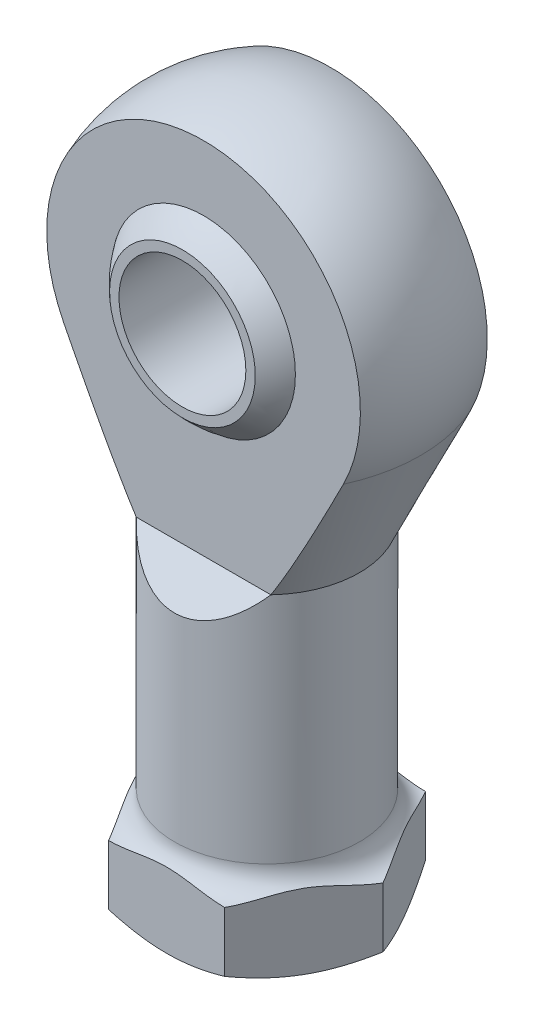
ISO-10303-21;
HEADER;
FILE_DESCRIPTION(('STEP AP214'),'2;1');
FILE_NAME('part.step','',(''),(''),'','','');
FILE_SCHEMA(('AUTOMOTIVE_DESIGN { 1 0 10303 214 1 1 1 1 }'));
ENDSEC;
DATA;
#1=APPLICATION_CONTEXT('core data for automotive mechanical design processes');
#2=APPLICATION_PROTOCOL_DEFINITION('international standard','automotive_design',2000,#1);
#3=PRODUCT_CONTEXT('',#1,'mechanical');
#4=PRODUCT('Part','Part','',(#3));
#5=PRODUCT_RELATED_PRODUCT_CATEGORY('part','',(#4));
#6=PRODUCT_DEFINITION_FORMATION('','',#4);
#7=PRODUCT_DEFINITION_CONTEXT('part definition',#1,'design');
#8=PRODUCT_DEFINITION('design','',#6,#7);
#9=PRODUCT_DEFINITION_SHAPE('','',#8);
#10=(LENGTH_UNIT() NAMED_UNIT(*) SI_UNIT(.MILLI.,.METRE.));
#11=(NAMED_UNIT(*) PLANE_ANGLE_UNIT() SI_UNIT($,.RADIAN.));
#12=(NAMED_UNIT(*) SI_UNIT($,.STERADIAN.) SOLID_ANGLE_UNIT());
#13=UNCERTAINTY_MEASURE_WITH_UNIT(LENGTH_MEASURE(1.E-05),#10,'distance_accuracy_value','');
#14=(GEOMETRIC_REPRESENTATION_CONTEXT(3) GLOBAL_UNCERTAINTY_ASSIGNED_CONTEXT((#13)) GLOBAL_UNIT_ASSIGNED_CONTEXT((#10,
#11,#12)) REPRESENTATION_CONTEXT('',''));
#15=CARTESIAN_POINT('',(0.,0.,0.));
#16=DIRECTION('',(0.,0.,1.));
#17=DIRECTION('',(1.,0.,0.));
#18=AXIS2_PLACEMENT_3D('',#15,#16,#17);
#19=CARTESIAN_POINT('',(0.,-10.4497660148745,0.));
#20=DIRECTION('',(0.,-1.,0.));
#21=DIRECTION('',(0.,0.,-1.));
#22=AXIS2_PLACEMENT_3D('',#19,#20,#21);
#23=CYLINDRICAL_SURFACE('',#22,1.5);
#24=CARTESIAN_POINT('',(0.,-10.4497660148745,0.));
#25=DIRECTION('',(0.,-1.,0.));
#26=DIRECTION('',(0.,0.,-1.));
#27=AXIS2_PLACEMENT_3D('',#24,#25,#26);
#28=CIRCLE('',#27,1.5);
#29=CARTESIAN_POINT('',(0.,-10.4497660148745,-1.5));
#30=VERTEX_POINT('',#29);
#31=EDGE_CURVE('P0_E19',#30,#30,#28,.T.);
#32=ORIENTED_EDGE('',*,*,#31,.F.);
#33=EDGE_LOOP('',(#32));
#34=FACE_BOUND('',#33,.T.);
#35=CARTESIAN_POINT('',(0.,-20.7679491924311,0.));
#36=DIRECTION('',(0.,1.,0.));
#37=DIRECTION('',(0.,0.,1.));
#38=AXIS2_PLACEMENT_3D('',#35,#36,#37);
#39=CIRCLE('',#38,1.5);
#40=CARTESIAN_POINT('',(0.,-20.7679491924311,-1.5));
#41=VERTEX_POINT('',#40);
#42=EDGE_CURVE('P0_E385',#41,#41,#39,.T.);
#43=ORIENTED_EDGE('',*,*,#42,.F.);
#44=EDGE_LOOP('',(#43));
#45=FACE_BOUND('',#44,.T.);
#46=ADVANCED_FACE('P0_F16',(#34,#45),#23,.F.);
#47=CARTESIAN_POINT('',(0.,-22.5,0.));
#48=DIRECTION('',(0.,-1.,0.));
#49=DIRECTION('',(0.,0.,-1.));
#50=AXIS2_PLACEMENT_3D('',#47,#48,#49);
#51=CONICAL_SURFACE('',#50,4.5,1.0471975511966);
#52=CARTESIAN_POINT('',(0.,-22.5,0.));
#53=DIRECTION('',(0.,-1.,0.));
#54=DIRECTION('',(0.,0.,1.));
#55=AXIS2_PLACEMENT_3D('',#52,#53,#54);
#56=CIRCLE('',#55,4.5);
#57=CARTESIAN_POINT('',(0.,-22.5,-4.49999999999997));
#58=VERTEX_POINT('',#57);
#59=EDGE_CURVE('P0_E381',#58,#58,#56,.F.);
#60=CARTESIAN_POINT('',(0.,-22.5,-4.49999999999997));
#61=CARTESIAN_POINT('',(0.,-22.4819578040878,-4.46874999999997));
#62=CARTESIAN_POINT('',(0.,-22.4639156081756,-4.43749999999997));
#63=CARTESIAN_POINT('',(0.,-22.4278312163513,-4.37499999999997));
#64=CARTESIAN_POINT('',(0.,-22.4097890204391,-4.34374999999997));
#65=CARTESIAN_POINT('',(0.,-22.3737046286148,-4.28124999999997));
#66=CARTESIAN_POINT('',(0.,-22.3556624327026,-4.24999999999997));
#67=CARTESIAN_POINT('',(0.,-22.3195780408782,-4.18749999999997));
#68=CARTESIAN_POINT('',(0.,-22.3015358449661,-4.15624999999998));
#69=CARTESIAN_POINT('',(0.,-22.2654514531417,-4.09374999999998));
#70=CARTESIAN_POINT('',(0.,-22.2474092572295,-4.06249999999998));
#71=CARTESIAN_POINT('',(0.,-22.2113248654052,-3.99999999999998));
#72=CARTESIAN_POINT('',(0.,-22.193282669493,-3.96874999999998));
#73=CARTESIAN_POINT('',(0.,-22.1571982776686,-3.90624999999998));
#74=CARTESIAN_POINT('',(0.,-22.1391560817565,-3.87499999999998));
#75=CARTESIAN_POINT('',(0.,-22.1030716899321,-3.81249999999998));
#76=CARTESIAN_POINT('',(0.,-22.0850294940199,-3.78124999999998));
#77=CARTESIAN_POINT('',(0.,-22.0489451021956,-3.71874999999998));
#78=CARTESIAN_POINT('',(0.,-22.0309029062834,-3.68749999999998));
#79=CARTESIAN_POINT('',(0.,-21.9948185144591,-3.62499999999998));
#80=CARTESIAN_POINT('',(0.,-21.9767763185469,-3.59374999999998));
#81=CARTESIAN_POINT('',(0.,-21.9406919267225,-3.53124999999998));
#82=CARTESIAN_POINT('',(0.,-21.9226497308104,-3.49999999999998));
#83=CARTESIAN_POINT('',(0.,-21.886565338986,-3.43749999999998));
#84=CARTESIAN_POINT('',(0.,-21.8685231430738,-3.40624999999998));
#85=CARTESIAN_POINT('',(0.,-21.8324387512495,-3.34374999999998));
#86=CARTESIAN_POINT('',(0.,-21.8143965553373,-3.31249999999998));
#87=CARTESIAN_POINT('',(0.,-21.778312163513,-3.24999999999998));
#88=CARTESIAN_POINT('',(0.,-21.7602699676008,-3.21874999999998));
#89=CARTESIAN_POINT('',(0.,-21.7241855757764,-3.15624999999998));
#90=CARTESIAN_POINT('',(0.,-21.7061433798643,-3.12499999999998));
#91=CARTESIAN_POINT('',(0.,-21.6700589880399,-3.06249999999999));
#92=CARTESIAN_POINT('',(0.,-21.6520167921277,-3.03124999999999));
#93=CARTESIAN_POINT('',(0.,-21.6159324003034,-2.96874999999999));
#94=CARTESIAN_POINT('',(0.,-21.5978902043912,-2.93749999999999));
#95=CARTESIAN_POINT('',(0.,-21.5618058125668,-2.87499999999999));
#96=CARTESIAN_POINT('',(0.,-21.5437636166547,-2.84374999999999));
#97=CARTESIAN_POINT('',(0.,-21.5076792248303,-2.78124999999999));
#98=CARTESIAN_POINT('',(0.,-21.4896370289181,-2.74999999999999));
#99=CARTESIAN_POINT('',(0.,-21.4535526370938,-2.68749999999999));
#100=CARTESIAN_POINT('',(0.,-21.4355104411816,-2.65624999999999));
#101=CARTESIAN_POINT('',(0.,-21.3994260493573,-2.59374999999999));
#102=CARTESIAN_POINT('',(0.,-21.3813838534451,-2.56249999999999));
#103=CARTESIAN_POINT('',(0.,-21.3452994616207,-2.49999999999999));
#104=CARTESIAN_POINT('',(0.,-21.3272572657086,-2.46874999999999));
#105=CARTESIAN_POINT('',(0.,-21.2911728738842,-2.40624999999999));
#106=CARTESIAN_POINT('',(0.,-21.273130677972,-2.37499999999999));
#107=CARTESIAN_POINT('',(0.,-21.2370462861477,-2.31249999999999));
#108=CARTESIAN_POINT('',(0.,-21.2190040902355,-2.28124999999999));
#109=CARTESIAN_POINT('',(0.,-21.1829196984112,-2.21874999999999));
#110=CARTESIAN_POINT('',(0.,-21.164877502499,-2.18749999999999));
#111=CARTESIAN_POINT('',(0.,-21.1287931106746,-2.12499999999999));
#112=CARTESIAN_POINT('',(0.,-21.1107509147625,-2.09374999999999));
#113=CARTESIAN_POINT('',(0.,-21.0746665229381,-2.03125));
#114=CARTESIAN_POINT('',(0.,-21.0566243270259,-2.));
#115=CARTESIAN_POINT('',(0.,-21.0205399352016,-1.9375));
#116=CARTESIAN_POINT('',(0.,-21.0024977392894,-1.90625));
#117=CARTESIAN_POINT('',(0.,-20.9664133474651,-1.84375));
#118=CARTESIAN_POINT('',(0.,-20.9483711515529,-1.8125));
#119=CARTESIAN_POINT('',(0.,-20.9122867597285,-1.75));
#120=CARTESIAN_POINT('',(0.,-20.8942445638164,-1.71875));
#121=CARTESIAN_POINT('',(0.,-20.858160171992,-1.65625));
#122=CARTESIAN_POINT('',(0.,-20.8401179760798,-1.625));
#123=CARTESIAN_POINT('',(0.,-20.8040335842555,-1.5625));
#124=CARTESIAN_POINT('',(0.,-20.7859913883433,-1.53125));
#125=CARTESIAN_POINT('',(0.,-20.7679491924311,-1.5));
#126=B_SPLINE_CURVE_WITH_KNOTS('',3,(#60,#61,#62,#63,#64,#65,#66,#67,#68,#69,#70,#71,#72,#73,
#74,#75,#76,#77,#78,#79,#80,#81,#82,#83,#84,#85,#86,#87,#88,#89,#90,#91,#92,#93,#94,#95,#96,#97,
#98,#99,#100,#101,#102,#103,#104,#105,#106,#107,#108,#109,#110,#111,#112,#113,#114,#115,#116,
#117,#118,#119,#120,#121,#122,#123,#124,#125),.UNSPECIFIED.,.F.,.F.,(4,2,2,2,2,2,2,2,2,2,2,2,2,
2,2,2,2,2,2,2,2,2,2,2,2,2,2,2,2,2,2,2,4),(0.,0.108253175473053,0.216506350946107,
0.324759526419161,0.433012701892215,0.541265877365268,0.649519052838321,0.757772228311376,
0.86602540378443,0.974278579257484,1.08253175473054,1.19078493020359,1.29903810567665,
1.4072912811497,1.51554445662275,1.62379763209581,1.73205080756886,1.84030398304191,
1.94855715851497,2.05681033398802,2.16506350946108,2.27331668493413,2.38156986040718,
2.48982303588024,2.59807621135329,2.70632938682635,2.8145825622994,2.92283573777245,
3.03108891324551,3.13934208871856,3.24759526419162,3.35584843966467,3.46410161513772),.UNSPECIFIED.);
#127=EDGE_CURVE('P0_BSEAM564',#58,#41,#126,.T.);
#128=ORIENTED_EDGE('',*,*,#59,.F.);
#129=ORIENTED_EDGE('',*,*,#42,.T.);
#130=ORIENTED_EDGE('',*,*,#127,.T.);
#131=ORIENTED_EDGE('',*,*,#127,.F.);
#132=EDGE_LOOP('',(#128,#130,#129,#131));
#133=FACE_BOUND('',#132,.T.);
#134=ADVANCED_FACE('P0_F564',(#133),#51,.F.);
#135=CARTESIAN_POINT('',(0.,0.,0.));
#136=DIRECTION('',(0.,0.,1.));
#137=DIRECTION('',(-1.,0.,0.));
#138=AXIS2_PLACEMENT_3D('',#135,#136,#137);
#139=SPHERICAL_SURFACE('',#138,10.556875);
#140=CARTESIAN_POINT('',(0.,0.,-6.));
#141=DIRECTION('',(0.,0.,1.));
#142=DIRECTION('',(1.,0.,0.));
#143=AXIS2_PLACEMENT_3D('',#140,#141,#142);
#144=CIRCLE('',#143,8.6860583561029);
#145=CARTESIAN_POINT('',(8.6860583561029,0.,-6.));
#146=VERTEX_POINT('',#145);
#147=EDGE_CURVE('P0_E136',#146,#146,#144,.T.);
#148=ORIENTED_EDGE('',*,*,#147,.F.);
#149=EDGE_LOOP('',(#148));
#150=FACE_BOUND('',#149,.T.);
#151=CARTESIAN_POINT('',(0.,0.,6.));
#152=DIRECTION('',(0.,0.,1.));
#153=DIRECTION('',(1.,0.,0.));
#154=AXIS2_PLACEMENT_3D('',#151,#152,#153);
#155=CIRCLE('',#154,8.6860583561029);
#156=CARTESIAN_POINT('',(8.6860583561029,0.,6.));
#157=VERTEX_POINT('',#156);
#158=EDGE_CURVE('P0_E119',#157,#157,#155,.F.);
#159=ORIENTED_EDGE('',*,*,#158,.F.);
#160=EDGE_LOOP('',(#159));
#161=FACE_BOUND('',#160,.T.);
#162=ORIENTED_EDGE('',*,*,#31,.T.);
#163=EDGE_LOOP('',(#162));
#164=FACE_BOUND('',#163,.T.);
#165=ADVANCED_FACE('P0_F378',(#150,#161,#164),#139,.F.);
#166=CARTESIAN_POINT('',(0.,-22.5,0.));
#167=DIRECTION('',(0.,-1.,0.));
#168=DIRECTION('',(0.,0.,-1.));
#169=AXIS2_PLACEMENT_3D('',#166,#167,#168);
#170=CYLINDRICAL_SURFACE('',#169,4.5);
#171=CARTESIAN_POINT('',(0.,-50.,0.));
#172=DIRECTION('',(0.,-1.,0.));
#173=DIRECTION('',(0.,0.,-1.));
#174=AXIS2_PLACEMENT_3D('',#171,#172,#173);
#175=CIRCLE('',#174,4.5);
#176=CARTESIAN_POINT('',(0.,-50.,-4.5));
#177=VERTEX_POINT('',#176);
#178=EDGE_CURVE('P0_E129',#177,#177,#175,.F.);
#179=ORIENTED_EDGE('',*,*,#178,.F.);
#180=EDGE_LOOP('',(#179));
#181=FACE_BOUND('',#180,.T.);
#182=ORIENTED_EDGE('',*,*,#59,.T.);
#183=EDGE_LOOP('',(#182));
#184=FACE_BOUND('',#183,.T.);
#185=ADVANCED_FACE('P0_F184',(#181,#184),#170,.F.);
#186=CARTESIAN_POINT('',(14.8323969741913,-19.2,6.));
#187=CARTESIAN_POINT('',(14.8323969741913,14.8323969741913,6.));
#188=CARTESIAN_POINT('',(14.8323969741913,15.1727209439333,6.));
#189=B_SPLINE_CURVE_WITH_KNOTS('',1,(#186,#187,#188),.UNSPECIFIED.,.F.,.F.,(2,1,2),(0.,1.,1.01),.UNSPECIFIED.);
#190=DIRECTION('',(-1.,0.,0.));
#191=VECTOR('',#190,1.);
#192=SURFACE_OF_LINEAR_EXTRUSION('',#189,#191);
#193=ORIENTED_EDGE('',*,*,#158,.T.);
#194=EDGE_LOOP('',(#193));
#195=FACE_BOUND('',#194,.T.);
#196=CARTESIAN_POINT('',(13.2253621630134,-6.7148935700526,6.));
#197=CARTESIAN_POINT('',(13.0102670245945,-7.13851344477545,6.));
#198=CARTESIAN_POINT('',(12.7944764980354,-7.56178157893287,6.));
#199=CARTESIAN_POINT('',(12.3612937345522,-8.4073843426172,6.));
#200=CARTESIAN_POINT('',(12.1439018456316,-8.82971915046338,6.));
#201=CARTESIAN_POINT('',(11.7072577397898,-9.67332130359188,6.));
#202=CARTESIAN_POINT('',(11.4880058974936,-10.0945888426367,6.));
#203=CARTESIAN_POINT('',(11.0473052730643,-10.9358811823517,6.));
#204=CARTESIAN_POINT('',(10.8258568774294,-11.3559061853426,6.));
#205=CARTESIAN_POINT('',(10.3803432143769,-12.1944951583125,6.));
#206=CARTESIAN_POINT('',(10.1562783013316,-12.6130593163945,6.));
#207=CARTESIAN_POINT('',(9.70492411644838,-13.4485743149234,6.));
#208=CARTESIAN_POINT('',(9.47763410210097,-13.8655247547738,6.));
#209=CARTESIAN_POINT('',(9.01919916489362,-14.6973033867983,6.));
#210=CARTESIAN_POINT('',(8.78805424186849,-15.1121315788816,6.));
#211=CARTESIAN_POINT('',(8.32099329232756,-15.9391442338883,6.));
#212=CARTESIAN_POINT('',(8.08507689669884,-16.3513284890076,6.));
#213=CARTESIAN_POINT('',(7.72668355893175,-16.9670440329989,6.));
#214=CARTESIAN_POINT('',(7.60645022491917,-17.1718819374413,6.));
#215=CARTESIAN_POINT('',(7.36428445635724,-17.5805492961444,6.));
#216=CARTESIAN_POINT('',(7.24235203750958,-17.7843787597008,6.));
#217=CARTESIAN_POINT('',(6.99648673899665,-18.1909920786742,6.));
#218=CARTESIAN_POINT('',(6.87255273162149,-18.3937752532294,6.));
#219=CARTESIAN_POINT('',(6.62245563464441,-18.7979705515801,6.));
#220=CARTESIAN_POINT('',(6.49629247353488,-18.9993826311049,6.));
#221=CARTESIAN_POINT('',(6.36886960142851,-19.2,6.));
#222=B_SPLINE_CURVE_WITH_KNOTS('',3,(#196,#197,#198,#199,#200,#201,#202,#203,#204,#205,#206,
#207,#208,#209,#210,#211,#212,#213,#214,#215,#216,#217,#218,#219,#220,#221),.UNSPECIFIED.,.F.,
.F.,(4,2,2,2,2,2,2,2,2,2,2,2,4),(0.,1.42530022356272,2.85029934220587,4.27501795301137,
5.69949017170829,7.12377165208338,8.54838654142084,9.97300149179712,11.397727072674,
12.110273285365,12.8228129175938,13.5357690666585,14.2487481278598),.UNSPECIFIED.);
#223=CARTESIAN_POINT('',(13.2253621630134,-6.7148935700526,6.));
#224=VERTEX_POINT('',#223);
#225=CARTESIAN_POINT('',(6.3688696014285,-19.2,6.));
#226=VERTEX_POINT('',#225);
#227=EDGE_CURVE('P0_E123',#224,#226,#222,.T.);
#228=ORIENTED_EDGE('',*,*,#227,.F.);
#229=CARTESIAN_POINT('',(0.,0.,6.));
#230=DIRECTION('',(0.,0.,1.));
#231=DIRECTION('',(1.,0.,0.));
#232=AXIS2_PLACEMENT_3D('',#229,#230,#231);
#233=CIRCLE('',#232,14.8323969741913);
#234=CARTESIAN_POINT('',(-13.2253621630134,-6.7148935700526,6.));
#235=VERTEX_POINT('',#234);
#236=EDGE_CURVE('P0_E109',#235,#224,#233,.F.);
#237=ORIENTED_EDGE('',*,*,#236,.F.);
#238=CARTESIAN_POINT('',(-6.3688696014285,-19.2,6.));
#239=CARTESIAN_POINT('',(-6.50694910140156,-18.9825975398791,6.));
#240=CARTESIAN_POINT('',(-6.64355323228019,-18.7642652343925,6.));
#241=CARTESIAN_POINT('',(-6.91417248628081,-18.3260125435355,6.));
#242=CARTESIAN_POINT('',(-7.0481877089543,-18.1060922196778,6.));
#243=CARTESIAN_POINT('',(-7.31393814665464,-17.6650233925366,6.));
#244=CARTESIAN_POINT('',(-7.44567441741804,-17.4438755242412,6.));
#245=CARTESIAN_POINT('',(-7.70721342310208,-17.0004372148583,6.));
#246=CARTESIAN_POINT('',(-7.83701613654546,-16.7781467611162,6.));
#247=CARTESIAN_POINT('',(-8.22385027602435,-16.109880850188,6.));
#248=CARTESIAN_POINT('',(-8.47835043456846,-15.662439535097,6.));
#249=CARTESIAN_POINT('',(-8.98206504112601,-14.7646066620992,6.));
#250=CARTESIAN_POINT('',(-9.2312795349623,-14.3142151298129,6.));
#251=CARTESIAN_POINT('',(-9.72534541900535,-13.4113551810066,6.));
#252=CARTESIAN_POINT('',(-9.9701990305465,-12.9588879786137,6.));
#253=CARTESIAN_POINT('',(-10.4564803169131,-12.0520742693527,6.));
#254=CARTESIAN_POINT('',(-10.6979077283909,-11.5977276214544,6.));
#255=CARTESIAN_POINT('',(-11.177923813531,-10.6875152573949,6.));
#256=CARTESIAN_POINT('',(-11.416512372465,-10.2316494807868,6.));
#257=CARTESIAN_POINT('',(-11.8913007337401,-9.31868724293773,6.));
#258=CARTESIAN_POINT('',(-12.1275005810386,-8.86159080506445,6.));
#259=CARTESIAN_POINT('',(-12.4349357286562,-8.26340707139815,6.));
#260=CARTESIAN_POINT('',(-12.5070856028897,-8.12278907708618,6.));
#261=CARTESIAN_POINT('',(-12.6512023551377,-7.84146209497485,6.));
#262=CARTESIAN_POINT('',(-12.7231692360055,-7.70075310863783,6.));
#263=CARTESIAN_POINT('',(-12.8669356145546,-7.41923553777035,6.));
#264=CARTESIAN_POINT('',(-12.9387350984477,-7.27842694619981,6.));
#265=CARTESIAN_POINT('',(-13.0821699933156,-6.99672340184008,6.));
#266=CARTESIAN_POINT('',(-13.1538054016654,-6.85582844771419,6.));
#267=CARTESIAN_POINT('',(-13.2253621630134,-6.7148935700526,6.));
#268=B_SPLINE_CURVE_WITH_KNOTS('',3,(#238,#239,#240,#241,#242,#243,#244,#245,#246,#247,#248,
#249,#250,#251,#252,#253,#254,#255,#256,#257,#258,#259,#260,#261,#262,#263,#264,#265,#266,#267),
.UNSPECIFIED.,.F.,.F.,(4,2,2,2,2,2,2,2,2,2,2,2,2,2,4),(0.,0.77262229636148,1.54521482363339,
2.31743930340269,3.08967235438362,4.63388908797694,6.1780924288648,7.72148529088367,
9.26499614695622,10.8085691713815,12.3521130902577,12.8262556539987,13.3003907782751,
13.7745636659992,14.2487440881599),.UNSPECIFIED.);
#269=CARTESIAN_POINT('',(-6.3688696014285,-19.2,6.));
#270=VERTEX_POINT('',#269);
#271=EDGE_CURVE('P0_E189',#270,#235,#268,.T.);
#272=ORIENTED_EDGE('',*,*,#271,.F.);
#273=DIRECTION('',(-1.,0.,0.));
#274=VECTOR('',#273,1.);
#275=CARTESIAN_POINT('',(6.3688696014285,-19.2,6.));
#276=LINE('',#275,#274);
#277=EDGE_CURVE('P0_E126',#226,#270,#276,.T.);
#278=ORIENTED_EDGE('',*,*,#277,.F.);
#279=EDGE_LOOP('',(#228,#237,#272,#278));
#280=FACE_BOUND('',#279,.T.);
#281=ADVANCED_FACE('P0_F124',(#195,#280),#192,.T.);
#282=CARTESIAN_POINT('',(0.,0.,0.));
#283=DIRECTION('',(0.,0.,1.));
#284=DIRECTION('',(1.,0.,0.));
#285=AXIS2_PLACEMENT_3D('',#282,#283,#284);
#286=SPHERICAL_SURFACE('',#285,16.);
#287=CARTESIAN_POINT('',(0.,-6.7148935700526,0.));
#288=DIRECTION('',(0.,1.,0.));
#289=DIRECTION('',(0.,0.,1.));
#290=AXIS2_PLACEMENT_3D('',#287,#288,#289);
#291=CIRCLE('',#290,14.5227478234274);
#292=CARTESIAN_POINT('',(-13.2253621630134,-6.71489357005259,-6.));
#293=VERTEX_POINT('',#292);
#294=EDGE_CURVE('P0_E107',#235,#293,#291,.F.);
#295=ORIENTED_EDGE('',*,*,#294,.F.);
#296=ORIENTED_EDGE('',*,*,#236,.T.);
#297=CARTESIAN_POINT('',(0.,-6.7148935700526,0.));
#298=DIRECTION('',(0.,1.,0.));
#299=DIRECTION('',(0.,0.,1.));
#300=AXIS2_PLACEMENT_3D('',#297,#298,#299);
#301=CIRCLE('',#300,14.5227478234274);
#302=CARTESIAN_POINT('',(13.2253621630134,-6.7148935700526,-6.));
#303=VERTEX_POINT('',#302);
#304=EDGE_CURVE('P0_E113',#303,#224,#301,.F.);
#305=ORIENTED_EDGE('',*,*,#304,.F.);
#306=CARTESIAN_POINT('',(0.,0.,-6.));
#307=DIRECTION('',(0.,0.,1.));
#308=DIRECTION('',(1.,0.,0.));
#309=AXIS2_PLACEMENT_3D('',#306,#307,#308);
#310=CIRCLE('',#309,14.8323969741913);
#311=EDGE_CURVE('P0_E118',#293,#303,#310,.F.);
#312=ORIENTED_EDGE('',*,*,#311,.F.);
#313=EDGE_LOOP('',(#295,#296,#305,#312));
#314=FACE_BOUND('',#313,.T.);
#315=ADVANCED_FACE('P0_F111',(#314),#286,.T.);
#316=CARTESIAN_POINT('',(14.8323969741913,15.1727209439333,-6.));
#317=CARTESIAN_POINT('',(14.8323969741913,14.8323969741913,-6.));
#318=CARTESIAN_POINT('',(14.8323969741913,-19.2,-6.));
#319=B_SPLINE_CURVE_WITH_KNOTS('',1,(#316,#317,#318),.UNSPECIFIED.,.F.,.F.,(2,1,2),(-0.01,0.,
1.),.UNSPECIFIED.);
#320=DIRECTION('',(-1.,0.,0.));
#321=VECTOR('',#320,1.);
#322=SURFACE_OF_LINEAR_EXTRUSION('',#319,#321);
#323=ORIENTED_EDGE('',*,*,#147,.T.);
#324=EDGE_LOOP('',(#323));
#325=FACE_BOUND('',#324,.T.);
#326=CARTESIAN_POINT('',(-13.2253621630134,-6.7148935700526,-6.));
#327=CARTESIAN_POINT('',(-13.0102670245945,-7.13851344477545,-6.));
#328=CARTESIAN_POINT('',(-12.7944764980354,-7.56178157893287,-6.));
#329=CARTESIAN_POINT('',(-12.3612937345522,-8.4073843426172,-6.));
#330=CARTESIAN_POINT('',(-12.1439018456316,-8.82971915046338,-6.));
#331=CARTESIAN_POINT('',(-11.7072577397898,-9.67332130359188,-6.));
#332=CARTESIAN_POINT('',(-11.4880058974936,-10.0945888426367,-6.));
#333=CARTESIAN_POINT('',(-11.0473052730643,-10.9358811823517,-6.));
#334=CARTESIAN_POINT('',(-10.8258568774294,-11.3559061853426,-6.));
#335=CARTESIAN_POINT('',(-10.3803432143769,-12.1944951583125,-6.));
#336=CARTESIAN_POINT('',(-10.1562783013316,-12.6130593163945,-6.));
#337=CARTESIAN_POINT('',(-9.70492411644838,-13.4485743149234,-6.));
#338=CARTESIAN_POINT('',(-9.47763410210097,-13.8655247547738,-6.));
#339=CARTESIAN_POINT('',(-9.01919916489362,-14.6973033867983,-6.));
#340=CARTESIAN_POINT('',(-8.7880542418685,-15.1121315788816,-6.));
#341=CARTESIAN_POINT('',(-8.32099329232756,-15.9391442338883,-6.));
#342=CARTESIAN_POINT('',(-8.08507689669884,-16.3513284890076,-6.));
#343=CARTESIAN_POINT('',(-7.72668355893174,-16.9670440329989,-6.));
#344=CARTESIAN_POINT('',(-7.60645022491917,-17.1718819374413,-6.));
#345=CARTESIAN_POINT('',(-7.36428445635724,-17.5805492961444,-6.));
#346=CARTESIAN_POINT('',(-7.24235203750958,-17.7843787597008,-6.));
#347=CARTESIAN_POINT('',(-6.99648673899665,-18.1909920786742,-6.));
#348=CARTESIAN_POINT('',(-6.87255273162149,-18.3937752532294,-6.));
#349=CARTESIAN_POINT('',(-6.62245563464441,-18.7979705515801,-6.));
#350=CARTESIAN_POINT('',(-6.49629247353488,-18.999382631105,-6.));
#351=CARTESIAN_POINT('',(-6.36886960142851,-19.2,-6.));
#352=B_SPLINE_CURVE_WITH_KNOTS('',3,(#326,#327,#328,#329,#330,#331,#332,#333,#334,#335,#336,
#337,#338,#339,#340,#341,#342,#343,#344,#345,#346,#347,#348,#349,#350,#351),.UNSPECIFIED.,.F.,
.F.,(4,2,2,2,2,2,2,2,2,2,2,2,4),(0.,1.42530022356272,2.85029934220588,4.27501795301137,
5.69949017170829,7.12377165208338,8.54838654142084,9.97300149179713,11.397727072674,
12.110273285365,12.8228129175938,13.5357690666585,14.2487481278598),.UNSPECIFIED.);
#353=CARTESIAN_POINT('',(-6.3688696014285,-19.2,-6.));
#354=VERTEX_POINT('',#353);
#355=EDGE_CURVE('P0_E208',#293,#354,#352,.T.);
#356=ORIENTED_EDGE('',*,*,#355,.F.);
#357=ORIENTED_EDGE('',*,*,#311,.T.);
#358=CARTESIAN_POINT('',(6.3688696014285,-19.2,-6.));
#359=CARTESIAN_POINT('',(6.50694910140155,-18.9825975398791,-6.));
#360=CARTESIAN_POINT('',(6.64355323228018,-18.7642652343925,-6.));
#361=CARTESIAN_POINT('',(6.9141724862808,-18.3260125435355,-6.));
#362=CARTESIAN_POINT('',(7.04818770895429,-18.1060922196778,-6.));
#363=CARTESIAN_POINT('',(7.31393814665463,-17.6650233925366,-6.));
#364=CARTESIAN_POINT('',(7.44567441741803,-17.4438755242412,-6.));
#365=CARTESIAN_POINT('',(7.70721342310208,-17.0004372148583,-6.));
#366=CARTESIAN_POINT('',(7.83701613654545,-16.7781467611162,-6.));
#367=CARTESIAN_POINT('',(8.22385027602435,-16.109880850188,-6.));
#368=CARTESIAN_POINT('',(8.47835043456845,-15.662439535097,-6.));
#369=CARTESIAN_POINT('',(8.982065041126,-14.7646066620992,-6.));
#370=CARTESIAN_POINT('',(9.23127953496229,-14.3142151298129,-6.));
#371=CARTESIAN_POINT('',(9.72534541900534,-13.4113551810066,-6.));
#372=CARTESIAN_POINT('',(9.97019903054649,-12.9588879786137,-6.));
#373=CARTESIAN_POINT('',(10.4564803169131,-12.0520742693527,-6.));
#374=CARTESIAN_POINT('',(10.6979077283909,-11.5977276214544,-6.));
#375=CARTESIAN_POINT('',(11.1779238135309,-10.6875152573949,-6.));
#376=CARTESIAN_POINT('',(11.416512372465,-10.2316494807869,-6.));
#377=CARTESIAN_POINT('',(11.8913007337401,-9.31868724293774,-6.));
#378=CARTESIAN_POINT('',(12.1275005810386,-8.86159080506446,-6.));
#379=CARTESIAN_POINT('',(12.4349357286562,-8.26340707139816,-6.));
#380=CARTESIAN_POINT('',(12.5070856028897,-8.12278907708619,-6.));
#381=CARTESIAN_POINT('',(12.6512023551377,-7.84146209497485,-6.));
#382=CARTESIAN_POINT('',(12.7231692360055,-7.70075310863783,-6.));
#383=CARTESIAN_POINT('',(12.8669356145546,-7.41923553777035,-6.));
#384=CARTESIAN_POINT('',(12.9387350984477,-7.27842694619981,-6.));
#385=CARTESIAN_POINT('',(13.0821699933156,-6.99672340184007,-6.));
#386=CARTESIAN_POINT('',(13.1538054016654,-6.85582844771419,-6.));
#387=CARTESIAN_POINT('',(13.2253621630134,-6.7148935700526,-6.));
#388=B_SPLINE_CURVE_WITH_KNOTS('',3,(#358,#359,#360,#361,#362,#363,#364,#365,#366,#367,#368,
#369,#370,#371,#372,#373,#374,#375,#376,#377,#378,#379,#380,#381,#382,#383,#384,#385,#386,#387),
.UNSPECIFIED.,.F.,.F.,(4,2,2,2,2,2,2,2,2,2,2,2,2,2,4),(0.,0.772622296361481,1.5452148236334,
2.31743930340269,3.08967235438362,4.63388908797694,6.1780924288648,7.72148529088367,
9.26499614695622,10.8085691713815,12.3521130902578,12.8262556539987,13.3003907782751,
13.7745636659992,14.2487440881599),.UNSPECIFIED.);
#389=CARTESIAN_POINT('',(6.3688696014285,-19.2,-6.));
#390=VERTEX_POINT('',#389);
#391=EDGE_CURVE('P0_E134',#390,#303,#388,.T.);
#392=ORIENTED_EDGE('',*,*,#391,.F.);
#393=DIRECTION('',(-1.,0.,0.));
#394=VECTOR('',#393,1.);
#395=CARTESIAN_POINT('',(6.3688696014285,-19.2,-6.));
#396=LINE('',#395,#394);
#397=EDGE_CURVE('P0_E214',#354,#390,#396,.F.);
#398=ORIENTED_EDGE('',*,*,#397,.F.);
#399=EDGE_LOOP('',(#356,#357,#392,#398));
#400=FACE_BOUND('',#399,.T.);
#401=ADVANCED_FACE('P0_F152',(#325,#400),#322,.T.);
#402=CARTESIAN_POINT('',(0.,-19.2,0.));
#403=DIRECTION('',(0.,1.,0.));
#404=DIRECTION('',(0.,0.,1.));
#405=AXIS2_PLACEMENT_3D('',#402,#403,#404);
#406=CONICAL_SURFACE('',#405,8.75,0.433093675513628);
#407=ORIENTED_EDGE('',*,*,#227,.T.);
#408=CARTESIAN_POINT('',(0.,-19.2,0.));
#409=DIRECTION('',(0.,-1.,0.));
#410=DIRECTION('',(0.,0.,1.));
#411=AXIS2_PLACEMENT_3D('',#408,#409,#410);
#412=CIRCLE('',#411,8.75);
#413=EDGE_CURVE('P0_E222',#390,#226,#412,.T.);
#414=ORIENTED_EDGE('',*,*,#413,.F.);
#415=ORIENTED_EDGE('',*,*,#391,.T.);
#416=ORIENTED_EDGE('',*,*,#304,.T.);
#417=EDGE_LOOP('',(#407,#414,#415,#416));
#418=FACE_BOUND('',#417,.T.);
#419=ADVANCED_FACE('P0_F132',(#418),#406,.T.);
#420=CARTESIAN_POINT('',(9.61400330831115,-50.,-9.5));
#421=DIRECTION('',(0.,-1.,0.));
#422=DIRECTION('',(0.,0.,1.));
#423=AXIS2_PLACEMENT_3D('',#420,#421,#422);
#424=PLANE('',#423);
#425=ORIENTED_EDGE('',*,*,#178,.T.);
#426=EDGE_LOOP('',(#425));
#427=FACE_BOUND('',#426,.T.);
#428=CARTESIAN_POINT('',(0.,-50.,0.));
#429=DIRECTION('',(0.,1.,0.));
#430=DIRECTION('',(-1.,0.,0.));
#431=AXIS2_PLACEMENT_3D('',#428,#429,#430);
#432=CIRCLE('',#431,9.49999999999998);
#433=CARTESIAN_POINT('',(8.22724133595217,-50.,4.75));
#434=VERTEX_POINT('',#433);
#435=CARTESIAN_POINT('',(8.22724133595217,-50.,-4.75));
#436=VERTEX_POINT('',#435);
#437=EDGE_CURVE('P0_E196',#434,#436,#432,.T.);
#438=ORIENTED_EDGE('',*,*,#437,.F.);
#439=CARTESIAN_POINT('',(0.,-50.,0.));
#440=DIRECTION('',(0.,1.,0.));
#441=DIRECTION('',(0.,0.,1.));
#442=AXIS2_PLACEMENT_3D('',#439,#440,#441);
#443=CIRCLE('',#442,9.5);
#444=CARTESIAN_POINT('',(0.,-50.,9.5));
#445=VERTEX_POINT('',#444);
#446=EDGE_CURVE('P0_E588',#445,#434,#443,.T.);
#447=ORIENTED_EDGE('',*,*,#446,.F.);
#448=CARTESIAN_POINT('',(0.,-50.,0.));
#449=DIRECTION('',(0.,1.,0.));
#450=DIRECTION('',(0.,0.,1.));
#451=AXIS2_PLACEMENT_3D('',#448,#449,#450);
#452=CIRCLE('',#451,9.5);
#453=CARTESIAN_POINT('',(-8.22724133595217,-50.,4.75));
#454=VERTEX_POINT('',#453);
#455=EDGE_CURVE('P0_E587',#454,#445,#452,.T.);
#456=ORIENTED_EDGE('',*,*,#455,.F.);
#457=CARTESIAN_POINT('',(0.,-50.,0.));
#458=DIRECTION('',(0.,1.,0.));
#459=DIRECTION('',(-1.,0.,0.));
#460=AXIS2_PLACEMENT_3D('',#457,#458,#459);
#461=CIRCLE('',#460,9.49999999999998);
#462=CARTESIAN_POINT('',(-8.22724133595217,-50.,-4.75));
#463=VERTEX_POINT('',#462);
#464=EDGE_CURVE('P0_E449',#463,#454,#461,.T.);
#465=ORIENTED_EDGE('',*,*,#464,.F.);
#466=CARTESIAN_POINT('',(0.,-50.,0.));
#467=DIRECTION('',(0.,1.,0.));
#468=DIRECTION('',(0.,0.,1.));
#469=AXIS2_PLACEMENT_3D('',#466,#467,#468);
#470=CIRCLE('',#469,9.5);
#471=CARTESIAN_POINT('',(0.,-50.,-9.5));
#472=VERTEX_POINT('',#471);
#473=EDGE_CURVE('P0_E590',#472,#463,#470,.T.);
#474=ORIENTED_EDGE('',*,*,#473,.F.);
#475=CARTESIAN_POINT('',(0.,-50.,0.));
#476=DIRECTION('',(0.,1.,0.));
#477=DIRECTION('',(0.,0.,1.));
#478=AXIS2_PLACEMENT_3D('',#475,#476,#477);
#479=CIRCLE('',#478,9.5);
#480=EDGE_CURVE('P0_E353',#436,#472,#479,.T.);
#481=ORIENTED_EDGE('',*,*,#480,.F.);
#482=EDGE_LOOP('',(#438,#447,#456,#465,#474,#481));
#483=FACE_BOUND('',#482,.T.);
#484=ADVANCED_FACE('P0_F233',(#427,#483),#424,.T.);
#485=CARTESIAN_POINT('',(0.,-50.,0.));
#486=DIRECTION('',(0.,1.,0.));
#487=DIRECTION('',(-1.,0.,0.));
#488=AXIS2_PLACEMENT_3D('',#485,#486,#487);
#489=CONICAL_SURFACE('',#488,9.49999999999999,1.0471975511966);
#490=ORIENTED_EDGE('',*,*,#437,.T.);
#491=CARTESIAN_POINT('',(10.9696551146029,-49.1514942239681,0.));
#492=CARTESIAN_POINT('',(10.7464238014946,-49.2804092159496,-0.3866479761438));
#493=CARTESIAN_POINT('',(10.5214047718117,-49.3985178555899,-0.776392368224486));
#494=CARTESIAN_POINT('',(10.0693831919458,-49.6068003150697,-1.55931671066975));
#495=CARTESIAN_POINT('',(9.84239640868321,-49.6971122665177,-1.95246935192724));
#496=CARTESIAN_POINT('',(9.49977402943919,-49.8080000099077,-2.54590872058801));
#497=CARTESIAN_POINT('',(9.38513376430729,-49.8408793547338,-2.74447148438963));
#498=CARTESIAN_POINT('',(9.15530440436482,-49.8977941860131,-3.14254761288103));
#499=CARTESIAN_POINT('',(9.04011532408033,-49.921829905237,-3.3420609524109));
#500=CARTESIAN_POINT('',(8.80876226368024,-49.9606351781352,-3.74277620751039));
#501=CARTESIAN_POINT('',(8.69259629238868,-49.9753576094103,-3.94398157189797));
#502=CARTESIAN_POINT('',(8.46003588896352,-49.9950603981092,-4.34678800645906));
#503=CARTESIAN_POINT('',(8.3436414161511,-50.000038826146,-4.54838914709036));
#504=CARTESIAN_POINT('',(8.22724133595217,-50.,-4.75));
#505=B_SPLINE_CURVE_WITH_KNOTS('',3,(#491,#492,#493,#494,#495,#496,#497,#498,#499,#500,#501,
#502,#503,#504),.UNSPECIFIED.,.F.,.F.,(4,2,2,2,2,2,4),(0.,1.39466965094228,2.78229242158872,
3.47701423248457,4.17171775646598,4.86990873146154,5.56823793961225),.UNSPECIFIED.);
#506=CARTESIAN_POINT('',(10.9696551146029,-49.1514942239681,0.));
#507=VERTEX_POINT('',#506);
#508=EDGE_CURVE('P0_E215',#507,#436,#505,.T.);
#509=ORIENTED_EDGE('',*,*,#508,.F.);
#510=CARTESIAN_POINT('',(8.22724133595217,-50.,4.74999999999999));
#511=CARTESIAN_POINT('',(8.3436414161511,-50.000038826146,4.54838914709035));
#512=CARTESIAN_POINT('',(8.46003588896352,-49.9950603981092,4.34678800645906));
#513=CARTESIAN_POINT('',(8.69259629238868,-49.9753576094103,3.94398157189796));
#514=CARTESIAN_POINT('',(8.80876226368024,-49.9606351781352,3.74277620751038));
#515=CARTESIAN_POINT('',(9.04011532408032,-49.921829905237,3.34206095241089));
#516=CARTESIAN_POINT('',(9.15530440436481,-49.8977941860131,3.14254761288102));
#517=CARTESIAN_POINT('',(9.38513376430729,-49.8408793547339,2.74447148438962));
#518=CARTESIAN_POINT('',(9.49977402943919,-49.8080000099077,2.545908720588));
#519=CARTESIAN_POINT('',(9.84239640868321,-49.6971122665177,1.95246935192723));
#520=CARTESIAN_POINT('',(10.0693831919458,-49.6068003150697,1.55931671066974));
#521=CARTESIAN_POINT('',(10.5214047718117,-49.3985178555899,0.776392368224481));
#522=CARTESIAN_POINT('',(10.7464238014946,-49.2804092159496,0.386647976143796));
#523=CARTESIAN_POINT('',(10.9696551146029,-49.1514942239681,0.));
#524=B_SPLINE_CURVE_WITH_KNOTS('',3,(#510,#511,#512,#513,#514,#515,#516,#517,#518,#519,#520,
#521,#522,#523),.UNSPECIFIED.,.F.,.F.,(4,2,2,2,2,2,4),(0.,0.698329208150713,1.39652018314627,
2.09122370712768,2.78594551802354,4.17356828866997,5.56823793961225),.UNSPECIFIED.);
#525=EDGE_CURVE('P0_E237',#434,#507,#524,.T.);
#526=ORIENTED_EDGE('',*,*,#525,.F.);
#527=EDGE_LOOP('',(#490,#509,#526));
#528=FACE_BOUND('',#527,.T.);
#529=ADVANCED_FACE('P0_F230',(#528),#489,.T.);
#530=CARTESIAN_POINT('',(6.44529603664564,-22.5,8.75));
#531=DIRECTION('',(0.,0.64018439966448,0.768221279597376));
#532=DIRECTION('',(0.,0.768221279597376,-0.64018439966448));
#533=AXIS2_PLACEMENT_3D('',#530,#531,#532);
#534=PLANE('',#533);
#535=ORIENTED_EDGE('',*,*,#277,.T.);
#536=CARTESIAN_POINT('',(0.,-12.,0.));
#537=DIRECTION('',(0.,0.64018439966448,0.768221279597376));
#538=DIRECTION('',(0.,-0.768221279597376,0.64018439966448));
#539=AXIS2_PLACEMENT_3D('',#536,#537,#538);
#540=ELLIPSE('',#539,13.6679369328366,8.75);
#541=EDGE_CURVE('P0_E247',#226,#270,#540,.F.);
#542=ORIENTED_EDGE('',*,*,#541,.F.);
#543=EDGE_LOOP('',(#535,#542));
#544=FACE_BOUND('',#543,.T.);
#545=ADVANCED_FACE('P0_F203',(#544),#534,.T.);
#546=CARTESIAN_POINT('',(0.,-19.2,0.));
#547=DIRECTION('',(0.,1.,0.));
#548=DIRECTION('',(0.,0.,1.));
#549=AXIS2_PLACEMENT_3D('',#546,#547,#548);
#550=CONICAL_SURFACE('',#549,8.75,0.433093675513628);
#551=ORIENTED_EDGE('',*,*,#355,.T.);
#552=CARTESIAN_POINT('',(0.,-19.2,0.));
#553=DIRECTION('',(0.,-1.,0.));
#554=DIRECTION('',(0.,0.,1.));
#555=AXIS2_PLACEMENT_3D('',#552,#553,#554);
#556=CIRCLE('',#555,8.75);
#557=EDGE_CURVE('P0_E321',#270,#354,#556,.T.);
#558=ORIENTED_EDGE('',*,*,#557,.F.);
#559=ORIENTED_EDGE('',*,*,#271,.T.);
#560=ORIENTED_EDGE('',*,*,#294,.T.);
#561=EDGE_LOOP('',(#551,#558,#559,#560));
#562=FACE_BOUND('',#561,.T.);
#563=ADVANCED_FACE('P0_F197',(#562),#550,.T.);
#564=CARTESIAN_POINT('',(6.44529603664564,-19.2,-6.));
#565=DIRECTION('',(0.,0.640184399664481,-0.768221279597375));
#566=DIRECTION('',(0.,-0.768221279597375,-0.640184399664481));
#567=AXIS2_PLACEMENT_3D('',#564,#565,#566);
#568=PLANE('',#567);
#569=ORIENTED_EDGE('',*,*,#397,.T.);
#570=CARTESIAN_POINT('',(0.,-12.,0.));
#571=DIRECTION('',(0.,0.640184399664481,-0.768221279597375));
#572=DIRECTION('',(0.,-0.768221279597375,-0.640184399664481));
#573=AXIS2_PLACEMENT_3D('',#570,#571,#572);
#574=ELLIPSE('',#573,13.6679369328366,8.75);
#575=EDGE_CURVE('P0_E275',#354,#390,#574,.F.);
#576=ORIENTED_EDGE('',*,*,#575,.F.);
#577=EDGE_LOOP('',(#569,#576));
#578=FACE_BOUND('',#577,.T.);
#579=ADVANCED_FACE('P0_F202',(#578),#568,.T.);
#580=CARTESIAN_POINT('',(10.9696551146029,-50.0424377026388,0.));
#581=DIRECTION('',(0.866025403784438,0.,-0.5));
#582=DIRECTION('',(-0.5,0.,-0.866025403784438));
#583=AXIS2_PLACEMENT_3D('',#580,#581,#582);
#584=PLANE('',#583);
#585=CARTESIAN_POINT('',(5.48482755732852,-49.1514942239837,-9.4999999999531));
#586=CARTESIAN_POINT('',(5.70805887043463,-49.2804092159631,-9.11335202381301));
#587=CARTESIAN_POINT('',(5.9330779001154,-49.3985178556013,-8.72360763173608));
#588=CARTESIAN_POINT('',(6.3850994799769,-49.6068003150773,-7.94068328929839));
#589=CARTESIAN_POINT('',(6.61208626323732,-49.6971122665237,-7.54753064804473));
#590=CARTESIAN_POINT('',(6.95470864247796,-49.8080000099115,-6.9540912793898));
#591=CARTESIAN_POINT('',(7.06934890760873,-49.840879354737,-6.75552851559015));
#592=CARTESIAN_POINT('',(7.29917826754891,-49.8977941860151,-6.35745238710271));
#593=CARTESIAN_POINT('',(7.41436734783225,-49.9218299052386,-6.15793904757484));
#594=CARTESIAN_POINT('',(7.64572040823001,-49.960635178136,-5.75722379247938));
#595=CARTESIAN_POINT('',(7.76188637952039,-49.9753576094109,-5.55601842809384));
#596=CARTESIAN_POINT('',(7.99444678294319,-49.9950603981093,-5.15321199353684));
#597=CARTESIAN_POINT('',(8.11084125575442,-50.000038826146,-4.95161085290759));
#598=CARTESIAN_POINT('',(8.22724133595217,-50.,-4.75));
#599=B_SPLINE_CURVE_WITH_KNOTS('',3,(#585,#586,#587,#588,#589,#590,#591,#592,#593,#594,#595,
#596,#597,#598),.UNSPECIFIED.,.F.,.F.,(4,2,2,2,2,2,4),(0.,1.39466965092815,2.78229242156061,
3.47701423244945,4.17171775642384,4.86990873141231,5.56823793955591),.UNSPECIFIED.);
#600=CARTESIAN_POINT('',(5.48482755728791,-49.1514942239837,-9.49999999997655));
#601=VERTEX_POINT('',#600);
#602=EDGE_CURVE('P0_E221',#601,#436,#599,.T.);
#603=ORIENTED_EDGE('',*,*,#602,.F.);
#604=DIRECTION('',(0.,1.,0.));
#605=VECTOR('',#604,1.);
#606=CARTESIAN_POINT('',(5.48482755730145,-50.,-9.5));
#607=LINE('',#606,#605);
#608=CARTESIAN_POINT('',(5.48482755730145,-43.49979536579,-9.5));
#609=VERTEX_POINT('',#608);
#610=EDGE_CURVE('P0_E314',#609,#601,#607,.F.);
#611=ORIENTED_EDGE('',*,*,#610,.F.);
#612=CARTESIAN_POINT('',(10.9696551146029,-43.49979536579,0.));
#613=CARTESIAN_POINT('',(10.8936064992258,-43.4987541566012,-0.131720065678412));
#614=CARTESIAN_POINT('',(10.8176011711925,-43.4939219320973,-0.263365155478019));
#615=CARTESIAN_POINT('',(10.665961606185,-43.4779967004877,-0.526012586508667));
#616=CARTESIAN_POINT('',(10.5903269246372,-43.466921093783,-0.657015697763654));
#617=CARTESIAN_POINT('',(10.439365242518,-43.4398235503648,-0.918489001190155));
#618=CARTESIAN_POINT('',(10.3640380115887,-43.4238065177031,-1.04895959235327));
#619=CARTESIAN_POINT('',(10.2136114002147,-43.388036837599,-1.30950612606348));
#620=CARTESIAN_POINT('',(10.1385120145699,-43.3682842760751,-1.43958207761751));
#621=CARTESIAN_POINT('',(9.98846810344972,-43.32624360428,-1.69946575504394));
#622=CARTESIAN_POINT('',(9.91352364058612,-43.303954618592,-1.82927337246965));
#623=CARTESIAN_POINT('',(9.76426150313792,-43.2582350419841,-2.08780297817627));
#624=CARTESIAN_POINT('',(9.68994311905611,-43.2348135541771,-2.21652619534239));
#625=CARTESIAN_POINT('',(9.54131029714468,-43.1879345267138,-2.47396579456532));
#626=CARTESIAN_POINT('',(9.46699585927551,-43.1644769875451,-2.60268217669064));
#627=CARTESIAN_POINT('',(9.31829087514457,-43.118838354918,-2.86024676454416));
#628=CARTESIAN_POINT('',(9.24390035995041,-43.0966568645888,-2.98909491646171));
#629=CARTESIAN_POINT('',(9.09496081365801,-43.0549181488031,-3.24706577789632));
#630=CARTESIAN_POINT('',(9.02041185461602,-43.0353599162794,-3.37618836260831));
#631=CARTESIAN_POINT('',(8.87107499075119,-43.0001891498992,-3.63484739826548));
#632=CARTESIAN_POINT('',(8.79628708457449,-42.9845766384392,-3.7643838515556));
#633=CARTESIAN_POINT('',(8.65419495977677,-42.9598314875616,-4.01049463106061));
#634=CARTESIAN_POINT('',(8.58691299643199,-42.950197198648,-4.12703041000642));
#635=CARTESIAN_POINT('',(8.45219937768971,-42.9357107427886,-4.36036124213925));
#636=CARTESIAN_POINT('',(8.38476768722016,-42.9308598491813,-4.47715635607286));
#637=CARTESIAN_POINT('',(8.2498689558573,-42.926294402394,-4.71080781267));
#638=CARTESIAN_POINT('',(8.18240192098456,-42.9265791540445,-4.82766414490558));
#639=CARTESIAN_POINT('',(8.04755058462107,-42.9322610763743,-5.06123351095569));
#640=CARTESIAN_POINT('',(7.98016626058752,-42.9376561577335,-5.17794658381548));
#641=CARTESIAN_POINT('',(7.84545319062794,-42.9531796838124,-5.41127646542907));
#642=CARTESIAN_POINT('',(7.7781246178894,-42.9633140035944,-5.5278929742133));
#643=CARTESIAN_POINT('',(7.64364034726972,-42.9876387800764,-5.76082656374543));
#644=CARTESIAN_POINT('',(7.57648468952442,-43.0018301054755,-5.877143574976));
#645=CARTESIAN_POINT('',(7.44233213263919,-43.033403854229,-6.10950261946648));
#646=CARTESIAN_POINT('',(7.37533532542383,-43.0507878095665,-6.22554449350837));
#647=CARTESIAN_POINT('',(7.24147952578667,-43.0877855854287,-6.45738953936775));
#648=CARTESIAN_POINT('',(7.174620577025,-43.1074000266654,-6.57319263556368));
#649=CARTESIAN_POINT('',(7.04032107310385,-43.1480808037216,-6.80580619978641));
#650=CARTESIAN_POINT('',(6.9728814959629,-43.1691598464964,-6.92261497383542));
#651=CARTESIAN_POINT('',(6.83805016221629,-43.2115968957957,-7.15614969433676));
#652=CARTESIAN_POINT('',(6.7706583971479,-43.2329547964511,-7.27287565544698));
#653=CARTESIAN_POINT('',(6.63585549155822,-43.275001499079,-7.50636113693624));
#654=CARTESIAN_POINT('',(6.56844437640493,-43.2956906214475,-7.62312061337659));
#655=CARTESIAN_POINT('',(6.43353891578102,-43.3354919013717,-7.85678372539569));
#656=CARTESIAN_POINT('',(6.36604462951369,-43.3546048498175,-7.97368725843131));
#657=CARTESIAN_POINT('',(6.23111330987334,-43.3903221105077,-8.20739515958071));
#658=CARTESIAN_POINT('',(6.16367681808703,-43.4069344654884,-8.32419858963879));
#659=CARTESIAN_POINT('',(6.02859869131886,-43.4368575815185,-8.5581607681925));
#660=CARTESIAN_POINT('',(5.96095700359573,-43.4501674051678,-8.67531960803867));
#661=CARTESIAN_POINT('',(5.82540250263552,-43.472610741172,-8.9101068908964));
#662=CARTESIAN_POINT('',(5.75748944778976,-43.4817386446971,-9.02773575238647));
#663=CARTESIAN_POINT('',(5.6213372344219,-43.4948730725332,-9.26355830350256));
#664=CARTESIAN_POINT('',(5.55309771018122,-43.4988640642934,-9.38175262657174));
#665=CARTESIAN_POINT('',(5.48482755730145,-43.49979536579,-9.5));
#666=B_SPLINE_CURVE_WITH_KNOTS('',3,(#612,#613,#614,#615,#616,#617,#618,#619,#620,#621,#622,
#623,#624,#625,#626,#627,#628,#629,#630,#631,#632,#633,#634,#635,#636,#637,#638,#639,#640,#641,
#642,#643,#644,#645,#646,#647,#648,#649,#650,#651,#652,#653,#654,#655,#656,#657,#658,#659,#660,
#661,#662,#663,#664,#665),.UNSPECIFIED.,.F.,.F.,(4,2,2,2,2,2,2,2,2,2,2,2,2,2,2,2,2,2,2,2,2,2,2,
2,2,2,4),(0.,0.456168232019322,0.911071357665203,1.36552446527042,1.81996712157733,
2.27456710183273,2.72597871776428,3.17738428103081,3.62864868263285,4.07973934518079,
4.53083256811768,4.93548311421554,5.34024134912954,5.74494479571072,6.14948285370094,
6.55452373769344,6.95965141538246,7.36497400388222,7.77040966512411,8.17995701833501,
8.58935316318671,8.99855017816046,9.40754060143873,9.81518609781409,10.2229471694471,
10.6312535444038,11.0407916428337),.UNSPECIFIED.);
#667=CARTESIAN_POINT('',(10.9696551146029,-43.49979536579,0.));
#668=VERTEX_POINT('',#667);
#669=EDGE_CURVE('P0_E274',#668,#609,#666,.T.);
#670=ORIENTED_EDGE('',*,*,#669,.F.);
#671=DIRECTION('',(0.,1.,0.));
#672=VECTOR('',#671,1.);
#673=CARTESIAN_POINT('',(10.9696551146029,-50.,0.));
#674=LINE('',#673,#672);
#675=EDGE_CURVE('P0_E245',#507,#668,#674,.T.);
#676=ORIENTED_EDGE('',*,*,#675,.F.);
#677=ORIENTED_EDGE('',*,*,#508,.T.);
#678=EDGE_LOOP('',(#603,#611,#670,#676,#677));
#679=FACE_BOUND('',#678,.T.);
#680=ADVANCED_FACE('P0_F228',(#679),#584,.T.);
#681=CARTESIAN_POINT('',(0.,-50.,0.));
#682=DIRECTION('',(0.,1.,0.));
#683=DIRECTION('',(0.,0.,1.));
#684=AXIS2_PLACEMENT_3D('',#681,#682,#683);
#685=CONICAL_SURFACE('',#684,9.5,1.0471975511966);
#686=ORIENTED_EDGE('',*,*,#480,.T.);
#687=CARTESIAN_POINT('',(5.4848275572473,-49.1514942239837,-9.5));
#688=CARTESIAN_POINT('',(5.03836493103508,-49.2804092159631,-9.5));
#689=CARTESIAN_POINT('',(4.58832687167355,-49.3985178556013,-9.5));
#690=CARTESIAN_POINT('',(3.68428371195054,-49.6068003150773,-9.5));
#691=CARTESIAN_POINT('',(3.23031014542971,-49.6971122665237,-9.5));
#692=CARTESIAN_POINT('',(2.54506538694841,-49.8080000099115,-9.5));
#693=CARTESIAN_POINT('',(2.31578485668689,-49.840879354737,-9.5));
#694=CARTESIAN_POINT('',(1.85612613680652,-49.8977941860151,-9.5));
#695=CARTESIAN_POINT('',(1.62574797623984,-49.9218299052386,-9.5));
#696=CARTESIAN_POINT('',(1.16304185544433,-49.960635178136,-9.5));
#697=CARTESIAN_POINT('',(0.930709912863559,-49.9753576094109,-9.5));
#698=CARTESIAN_POINT('',(0.465589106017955,-49.9950603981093,-9.5));
#699=CARTESIAN_POINT('',(0.232800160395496,-50.000038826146,-9.5));
#700=CARTESIAN_POINT('',(0.,-50.,-9.5));
#701=B_SPLINE_CURVE_WITH_KNOTS('',3,(#687,#688,#689,#690,#691,#692,#693,#694,#695,#696,#697,
#698,#699,#700),.UNSPECIFIED.,.F.,.F.,(4,2,2,2,2,2,4),(0.,1.39466965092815,2.78229242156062,
3.47701423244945,4.17171775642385,4.86990873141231,5.56823793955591),.UNSPECIFIED.);
#702=EDGE_CURVE('P0_E317',#601,#472,#701,.T.);
#703=ORIENTED_EDGE('',*,*,#702,.F.);
#704=ORIENTED_EDGE('',*,*,#602,.T.);
#705=EDGE_LOOP('',(#686,#703,#704));
#706=FACE_BOUND('',#705,.T.);
#707=ADVANCED_FACE('P0_F339',(#706),#685,.T.);
#708=CARTESIAN_POINT('',(0.,-50.,0.));
#709=DIRECTION('',(0.,1.,0.));
#710=DIRECTION('',(0.,0.,1.));
#711=AXIS2_PLACEMENT_3D('',#708,#709,#710);
#712=CONICAL_SURFACE('',#711,9.5,1.0471975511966);
#713=CARTESIAN_POINT('',(0.,-50.,-9.5));
#714=CARTESIAN_POINT('',(-0.232800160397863,-50.000038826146,-9.5));
#715=CARTESIAN_POINT('',(-0.465589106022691,-49.9950603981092,-9.5));
#716=CARTESIAN_POINT('',(-0.930709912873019,-49.9753576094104,-9.5));
#717=CARTESIAN_POINT('',(-1.16304185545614,-49.9606351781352,-9.5));
#718=CARTESIAN_POINT('',(-1.62574797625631,-49.9218299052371,-9.5));
#719=CARTESIAN_POINT('',(-1.85612613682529,-49.8977941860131,-9.5));
#720=CARTESIAN_POINT('',(-2.31578485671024,-49.8408793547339,-9.5));
#721=CARTESIAN_POINT('',(-2.54506538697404,-49.8080000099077,-9.5));
#722=CARTESIAN_POINT('',(-3.23031014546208,-49.6971122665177,-9.5));
#723=CARTESIAN_POINT('',(-3.68428371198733,-49.6068003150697,-9.5));
#724=CARTESIAN_POINT('',(-4.58832687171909,-49.3985178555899,-9.5));
#725=CARTESIAN_POINT('',(-5.03836493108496,-49.2804092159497,-9.5));
#726=CARTESIAN_POINT('',(-5.48482755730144,-49.1514942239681,-9.5));
#727=B_SPLINE_CURVE_WITH_KNOTS('',3,(#713,#714,#715,#716,#717,#718,#719,#720,#721,#722,#723,
#724,#725,#726),.UNSPECIFIED.,.F.,.F.,(4,2,2,2,2,2,4),(0.,0.698329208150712,1.39652018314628,
2.09122370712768,2.78594551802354,4.17356828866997,5.56823793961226),.UNSPECIFIED.);
#728=CARTESIAN_POINT('',(-5.48482755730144,-49.1514942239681,-9.5));
#729=VERTEX_POINT('',#728);
#730=EDGE_CURVE('P0_E305',#472,#729,#727,.T.);
#731=ORIENTED_EDGE('',*,*,#730,.F.);
#732=ORIENTED_EDGE('',*,*,#473,.T.);
#733=CARTESIAN_POINT('',(-5.48482755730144,-49.1514942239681,-9.5));
#734=CARTESIAN_POINT('',(-5.70805887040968,-49.2804092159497,-9.11335202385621));
#735=CARTESIAN_POINT('',(-5.93307790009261,-49.3985178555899,-8.72360763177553));
#736=CARTESIAN_POINT('',(-6.3850994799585,-49.6068003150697,-7.94068328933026));
#737=CARTESIAN_POINT('',(-6.61208626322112,-49.6971122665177,-7.54753064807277));
#738=CARTESIAN_POINT('',(-6.95470864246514,-49.8080000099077,-6.954091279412));
#739=CARTESIAN_POINT('',(-7.06934890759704,-49.8408793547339,-6.75552851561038));
#740=CARTESIAN_POINT('',(-7.29917826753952,-49.8977941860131,-6.35745238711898));
#741=CARTESIAN_POINT('',(-7.41436734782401,-49.9218299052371,-6.15793904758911));
#742=CARTESIAN_POINT('',(-7.64572040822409,-49.9606351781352,-5.75722379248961));
#743=CARTESIAN_POINT('',(-7.76188637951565,-49.9753576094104,-5.55601842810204));
#744=CARTESIAN_POINT('',(-7.99444678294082,-49.9950603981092,-5.15321199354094));
#745=CARTESIAN_POINT('',(-8.11084125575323,-50.000038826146,-4.95161085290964));
#746=CARTESIAN_POINT('',(-8.22724133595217,-50.,-4.75));
#747=B_SPLINE_CURVE_WITH_KNOTS('',3,(#733,#734,#735,#736,#737,#738,#739,#740,#741,#742,#743,
#744,#745,#746),.UNSPECIFIED.,.F.,.F.,(4,2,2,2,2,2,4),(0.,1.39466965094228,2.78229242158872,
3.47701423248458,4.17171775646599,4.86990873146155,5.56823793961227),.UNSPECIFIED.);
#748=EDGE_CURVE('P0_E304',#729,#463,#747,.T.);
#749=ORIENTED_EDGE('',*,*,#748,.F.);
#750=EDGE_LOOP('',(#731,#732,#749));
#751=FACE_BOUND('',#750,.T.);
#752=ADVANCED_FACE('P0_F344',(#751),#712,.T.);
#753=CARTESIAN_POINT('',(0.,-50.,0.));
#754=DIRECTION('',(0.,1.,0.));
#755=DIRECTION('',(-1.,0.,0.));
#756=AXIS2_PLACEMENT_3D('',#753,#754,#755);
#757=CONICAL_SURFACE('',#756,9.49999999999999,1.0471975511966);
#758=CARTESIAN_POINT('',(-8.22724133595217,-50.,-4.75));
#759=CARTESIAN_POINT('',(-8.3436414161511,-50.000038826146,-4.54838914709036));
#760=CARTESIAN_POINT('',(-8.46003588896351,-49.9950603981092,-4.34678800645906));
#761=CARTESIAN_POINT('',(-8.69259629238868,-49.9753576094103,-3.94398157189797));
#762=CARTESIAN_POINT('',(-8.80876226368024,-49.9606351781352,-3.74277620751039));
#763=CARTESIAN_POINT('',(-9.04011532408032,-49.921829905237,-3.3420609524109));
#764=CARTESIAN_POINT('',(-9.15530440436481,-49.8977941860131,-3.14254761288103));
#765=CARTESIAN_POINT('',(-9.38513376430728,-49.8408793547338,-2.74447148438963));
#766=CARTESIAN_POINT('',(-9.49977402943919,-49.8080000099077,-2.54590872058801));
#767=CARTESIAN_POINT('',(-9.84239640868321,-49.6971122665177,-1.95246935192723));
#768=CARTESIAN_POINT('',(-10.0693831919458,-49.6068003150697,-1.55931671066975));
#769=CARTESIAN_POINT('',(-10.5214047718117,-49.3985178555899,-0.776392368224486));
#770=CARTESIAN_POINT('',(-10.7464238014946,-49.2804092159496,-0.386647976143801));
#771=CARTESIAN_POINT('',(-10.9696551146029,-49.1514942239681,0.));
#772=B_SPLINE_CURVE_WITH_KNOTS('',3,(#758,#759,#760,#761,#762,#763,#764,#765,#766,#767,#768,
#769,#770,#771),.UNSPECIFIED.,.F.,.F.,(4,2,2,2,2,2,4),(0.,0.69832920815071,1.39652018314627,
2.09122370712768,2.78594551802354,4.17356828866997,5.56823793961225),.UNSPECIFIED.);
#773=CARTESIAN_POINT('',(-10.9696551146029,-49.1514942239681,0.));
#774=VERTEX_POINT('',#773);
#775=EDGE_CURVE('P0_E300',#463,#774,#772,.T.);
#776=ORIENTED_EDGE('',*,*,#775,.F.);
#777=ORIENTED_EDGE('',*,*,#464,.T.);
#778=CARTESIAN_POINT('',(-10.9696551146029,-49.1514942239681,0.));
#779=CARTESIAN_POINT('',(-10.7464238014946,-49.2804092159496,0.386647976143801));
#780=CARTESIAN_POINT('',(-10.5214047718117,-49.3985178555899,0.776392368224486));
#781=CARTESIAN_POINT('',(-10.0693831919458,-49.6068003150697,1.55931671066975));
#782=CARTESIAN_POINT('',(-9.84239640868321,-49.6971122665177,1.95246935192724));
#783=CARTESIAN_POINT('',(-9.49977402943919,-49.8080000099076,2.54590872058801));
#784=CARTESIAN_POINT('',(-9.38513376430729,-49.8408793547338,2.74447148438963));
#785=CARTESIAN_POINT('',(-9.15530440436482,-49.8977941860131,3.14254761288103));
#786=CARTESIAN_POINT('',(-9.04011532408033,-49.921829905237,3.3420609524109));
#787=CARTESIAN_POINT('',(-8.80876226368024,-49.9606351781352,3.74277620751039));
#788=CARTESIAN_POINT('',(-8.69259629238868,-49.9753576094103,3.94398157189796));
#789=CARTESIAN_POINT('',(-8.46003588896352,-49.9950603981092,4.34678800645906));
#790=CARTESIAN_POINT('',(-8.3436414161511,-50.000038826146,4.54838914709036));
#791=CARTESIAN_POINT('',(-8.22724133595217,-50.,4.75));
#792=B_SPLINE_CURVE_WITH_KNOTS('',3,(#778,#779,#780,#781,#782,#783,#784,#785,#786,#787,#788,
#789,#790,#791),.UNSPECIFIED.,.F.,.F.,(4,2,2,2,2,2,4),(0.,1.39466965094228,2.78229242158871,
3.47701423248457,4.17171775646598,4.86990873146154,5.56823793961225),.UNSPECIFIED.);
#793=EDGE_CURVE('P0_E299',#774,#454,#792,.T.);
#794=ORIENTED_EDGE('',*,*,#793,.F.);
#795=EDGE_LOOP('',(#776,#777,#794));
#796=FACE_BOUND('',#795,.T.);
#797=ADVANCED_FACE('P0_F423',(#796),#757,.T.);
#798=CARTESIAN_POINT('',(0.,-50.,0.));
#799=DIRECTION('',(0.,1.,0.));
#800=DIRECTION('',(0.,0.,1.));
#801=AXIS2_PLACEMENT_3D('',#798,#799,#800);
#802=CONICAL_SURFACE('',#801,9.5,1.0471975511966);
#803=CARTESIAN_POINT('',(-8.22724133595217,-50.,4.75));
#804=CARTESIAN_POINT('',(-8.11084125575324,-50.000038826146,4.95161085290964));
#805=CARTESIAN_POINT('',(-7.99444678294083,-49.9950603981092,5.15321199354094));
#806=CARTESIAN_POINT('',(-7.76188637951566,-49.9753576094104,5.55601842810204));
#807=CARTESIAN_POINT('',(-7.6457204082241,-49.9606351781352,5.75722379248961));
#808=CARTESIAN_POINT('',(-7.41436734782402,-49.9218299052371,6.1579390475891));
#809=CARTESIAN_POINT('',(-7.29917826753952,-49.8977941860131,6.35745238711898));
#810=CARTESIAN_POINT('',(-7.06934890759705,-49.8408793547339,6.75552851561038));
#811=CARTESIAN_POINT('',(-6.95470864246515,-49.8080000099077,6.95409127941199));
#812=CARTESIAN_POINT('',(-6.61208626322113,-49.6971122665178,7.54753064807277));
#813=CARTESIAN_POINT('',(-6.38509947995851,-49.6068003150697,7.94068328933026));
#814=CARTESIAN_POINT('',(-5.93307790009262,-49.3985178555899,8.72360763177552));
#815=CARTESIAN_POINT('',(-5.70805887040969,-49.2804092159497,9.11335202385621));
#816=CARTESIAN_POINT('',(-5.48482755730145,-49.1514942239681,9.5));
#817=B_SPLINE_CURVE_WITH_KNOTS('',3,(#803,#804,#805,#806,#807,#808,#809,#810,#811,#812,#813,
#814,#815,#816),.UNSPECIFIED.,.F.,.F.,(4,2,2,2,2,2,4),(0.,0.698329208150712,1.39652018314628,
2.09122370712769,2.78594551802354,4.17356828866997,5.56823793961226),.UNSPECIFIED.);
#818=CARTESIAN_POINT('',(-5.48482755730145,-49.1514942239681,9.5));
#819=VERTEX_POINT('',#818);
#820=EDGE_CURVE('P0_E295',#454,#819,#817,.T.);
#821=ORIENTED_EDGE('',*,*,#820,.F.);
#822=ORIENTED_EDGE('',*,*,#455,.T.);
#823=CARTESIAN_POINT('',(-5.48482755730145,-49.1514942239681,9.5));
#824=CARTESIAN_POINT('',(-5.03836493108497,-49.2804092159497,9.5));
#825=CARTESIAN_POINT('',(-4.5883268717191,-49.3985178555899,9.5));
#826=CARTESIAN_POINT('',(-3.68428371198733,-49.6068003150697,9.5));
#827=CARTESIAN_POINT('',(-3.23031014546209,-49.6971122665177,9.5));
#828=CARTESIAN_POINT('',(-2.54506538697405,-49.8080000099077,9.5));
#829=CARTESIAN_POINT('',(-2.31578485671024,-49.8408793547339,9.5));
#830=CARTESIAN_POINT('',(-1.8561261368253,-49.8977941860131,9.5));
#831=CARTESIAN_POINT('',(-1.62574797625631,-49.9218299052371,9.5));
#832=CARTESIAN_POINT('',(-1.16304185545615,-49.9606351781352,9.5));
#833=CARTESIAN_POINT('',(-0.930709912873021,-49.9753576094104,9.5));
#834=CARTESIAN_POINT('',(-0.465589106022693,-49.9950603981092,9.5));
#835=CARTESIAN_POINT('',(-0.232800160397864,-50.000038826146,9.5));
#836=CARTESIAN_POINT('',(0.,-50.,9.5));
#837=B_SPLINE_CURVE_WITH_KNOTS('',3,(#823,#824,#825,#826,#827,#828,#829,#830,#831,#832,#833,
#834,#835,#836),.UNSPECIFIED.,.F.,.F.,(4,2,2,2,2,2,4),(0.,1.39466965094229,2.78229242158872,
3.47701423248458,4.17171775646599,4.86990873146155,5.56823793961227),.UNSPECIFIED.);
#838=EDGE_CURVE('P0_E294',#819,#445,#837,.T.);
#839=ORIENTED_EDGE('',*,*,#838,.F.);
#840=EDGE_LOOP('',(#821,#822,#839));
#841=FACE_BOUND('',#840,.T.);
#842=ADVANCED_FACE('P0_F427',(#841),#802,.T.);
#843=CARTESIAN_POINT('',(0.,-50.,0.));
#844=DIRECTION('',(0.,1.,0.));
#845=DIRECTION('',(0.,0.,1.));
#846=AXIS2_PLACEMENT_3D('',#843,#844,#845);
#847=CONICAL_SURFACE('',#846,9.5,1.0471975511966);
#848=ORIENTED_EDGE('',*,*,#446,.T.);
#849=CARTESIAN_POINT('',(5.48482755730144,-49.1514942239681,9.5));
#850=CARTESIAN_POINT('',(5.70805887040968,-49.2804092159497,9.11335202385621));
#851=CARTESIAN_POINT('',(5.93307790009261,-49.3985178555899,8.72360763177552));
#852=CARTESIAN_POINT('',(6.3850994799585,-49.6068003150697,7.94068328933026));
#853=CARTESIAN_POINT('',(6.61208626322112,-49.6971122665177,7.54753064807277));
#854=CARTESIAN_POINT('',(6.95470864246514,-49.8080000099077,6.95409127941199));
#855=CARTESIAN_POINT('',(7.06934890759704,-49.8408793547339,6.75552851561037));
#856=CARTESIAN_POINT('',(7.29917826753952,-49.8977941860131,6.35745238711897));
#857=CARTESIAN_POINT('',(7.41436734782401,-49.9218299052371,6.1579390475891));
#858=CARTESIAN_POINT('',(7.6457204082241,-49.9606351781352,5.75722379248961));
#859=CARTESIAN_POINT('',(7.76188637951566,-49.9753576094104,5.55601842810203));
#860=CARTESIAN_POINT('',(7.99444678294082,-49.9950603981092,5.15321199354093));
#861=CARTESIAN_POINT('',(8.11084125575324,-50.000038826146,4.95161085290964));
#862=CARTESIAN_POINT('',(8.22724133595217,-50.,4.74999999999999));
#863=B_SPLINE_CURVE_WITH_KNOTS('',3,(#849,#850,#851,#852,#853,#854,#855,#856,#857,#858,#859,
#860,#861,#862),.UNSPECIFIED.,.F.,.F.,(4,2,2,2,2,2,4),(0.,1.39466965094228,2.78229242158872,
3.47701423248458,4.17171775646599,4.86990873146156,5.56823793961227),.UNSPECIFIED.);
#864=CARTESIAN_POINT('',(5.48482755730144,-49.1514942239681,9.5));
#865=VERTEX_POINT('',#864);
#866=EDGE_CURVE('P0_E246',#865,#434,#863,.T.);
#867=ORIENTED_EDGE('',*,*,#866,.F.);
#868=CARTESIAN_POINT('',(0.,-50.,9.5));
#869=CARTESIAN_POINT('',(0.232800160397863,-50.000038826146,9.5));
#870=CARTESIAN_POINT('',(0.465589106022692,-49.9950603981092,9.5));
#871=CARTESIAN_POINT('',(0.930709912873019,-49.9753576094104,9.5));
#872=CARTESIAN_POINT('',(1.16304185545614,-49.9606351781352,9.5));
#873=CARTESIAN_POINT('',(1.62574797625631,-49.9218299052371,9.5));
#874=CARTESIAN_POINT('',(1.85612613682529,-49.8977941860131,9.5));
#875=CARTESIAN_POINT('',(2.31578485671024,-49.8408793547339,9.5));
#876=CARTESIAN_POINT('',(2.54506538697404,-49.8080000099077,9.5));
#877=CARTESIAN_POINT('',(3.23031014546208,-49.6971122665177,9.5));
#878=CARTESIAN_POINT('',(3.68428371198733,-49.6068003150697,9.5));
#879=CARTESIAN_POINT('',(4.58832687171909,-49.3985178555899,9.5));
#880=CARTESIAN_POINT('',(5.03836493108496,-49.2804092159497,9.5));
#881=CARTESIAN_POINT('',(5.48482755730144,-49.1514942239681,9.5));
#882=B_SPLINE_CURVE_WITH_KNOTS('',3,(#868,#869,#870,#871,#872,#873,#874,#875,#876,#877,#878,
#879,#880,#881),.UNSPECIFIED.,.F.,.F.,(4,2,2,2,2,2,4),(0.,0.698329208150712,1.39652018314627,
2.09122370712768,2.78594551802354,4.17356828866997,5.56823793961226),.UNSPECIFIED.);
#883=EDGE_CURVE('P0_E313',#445,#865,#882,.T.);
#884=ORIENTED_EDGE('',*,*,#883,.F.);
#885=EDGE_LOOP('',(#848,#867,#884));
#886=FACE_BOUND('',#885,.T.);
#887=ADVANCED_FACE('P0_F259',(#886),#847,.T.);
#888=CARTESIAN_POINT('',(5.48482755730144,-50.0424377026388,9.5));
#889=DIRECTION('',(0.866025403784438,0.,0.5));
#890=DIRECTION('',(0.5,0.,-0.866025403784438));
#891=AXIS2_PLACEMENT_3D('',#888,#889,#890);
#892=PLANE('',#891);
#893=ORIENTED_EDGE('',*,*,#525,.T.);
#894=ORIENTED_EDGE('',*,*,#675,.T.);
#895=CARTESIAN_POINT('',(5.48482755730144,-43.49979536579,9.5));
#896=CARTESIAN_POINT('',(5.56087617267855,-43.4987541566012,9.36827993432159));
#897=CARTESIAN_POINT('',(5.63688150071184,-43.4939219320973,9.23663484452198));
#898=CARTESIAN_POINT('',(5.78852106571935,-43.4779967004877,8.97398741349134));
#899=CARTESIAN_POINT('',(5.8641557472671,-43.466921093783,8.84298430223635));
#900=CARTESIAN_POINT('',(6.01511742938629,-43.4398235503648,8.58151099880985));
#901=CARTESIAN_POINT('',(6.09044466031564,-43.4238065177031,8.45104040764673));
#902=CARTESIAN_POINT('',(6.24087127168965,-43.388036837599,8.19049387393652));
#903=CARTESIAN_POINT('',(6.31597065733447,-43.3682842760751,8.06041792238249));
#904=CARTESIAN_POINT('',(6.46601456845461,-43.32624360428,7.80053424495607));
#905=CARTESIAN_POINT('',(6.54095903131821,-43.303954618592,7.67072662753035));
#906=CARTESIAN_POINT('',(6.69022116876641,-43.2582350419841,7.41219702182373));
#907=CARTESIAN_POINT('',(6.76453955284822,-43.2348135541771,7.28347380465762));
#908=CARTESIAN_POINT('',(6.91317237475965,-43.1879345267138,7.02603420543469));
#909=CARTESIAN_POINT('',(6.98748681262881,-43.1644769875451,6.89731782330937));
#910=CARTESIAN_POINT('',(7.13619179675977,-43.118838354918,6.63975323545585));
#911=CARTESIAN_POINT('',(7.21058231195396,-43.0966568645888,6.51090508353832));
#912=CARTESIAN_POINT('',(7.35952185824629,-43.0549181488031,6.25293422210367));
#913=CARTESIAN_POINT('',(7.43407081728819,-43.0353599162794,6.12381163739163));
#914=CARTESIAN_POINT('',(7.58340768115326,-43.0001891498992,5.8651526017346));
#915=CARTESIAN_POINT('',(7.65819558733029,-42.9845766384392,5.73561614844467));
#916=CARTESIAN_POINT('',(7.80028771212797,-42.9598314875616,5.48950536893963));
#917=CARTESIAN_POINT('',(7.86756967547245,-42.950197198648,5.37296958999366));
#918=CARTESIAN_POINT('',(8.00228329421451,-42.9357107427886,5.13963875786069));
#919=CARTESIAN_POINT('',(8.06971498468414,-42.9308598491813,5.02284364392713));
#920=CARTESIAN_POINT('',(8.20461371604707,-42.926294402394,4.78919218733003));
#921=CARTESIAN_POINT('',(8.27208075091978,-42.9265791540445,4.67233585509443));
#922=CARTESIAN_POINT('',(8.40693208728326,-42.9322610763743,4.43876648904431));
#923=CARTESIAN_POINT('',(8.47431641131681,-42.9376561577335,4.32205341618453));
#924=CARTESIAN_POINT('',(8.6090294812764,-42.9531796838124,4.08872353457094));
#925=CARTESIAN_POINT('',(8.67635805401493,-42.9633140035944,3.9721070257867));
#926=CARTESIAN_POINT('',(8.81084232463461,-42.9876387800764,3.73917343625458));
#927=CARTESIAN_POINT('',(8.87799798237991,-43.0018301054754,3.62285642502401));
#928=CARTESIAN_POINT('',(9.01215053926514,-43.033403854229,3.39049738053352));
#929=CARTESIAN_POINT('',(9.07914734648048,-43.0507878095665,3.27445550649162));
#930=CARTESIAN_POINT('',(9.21300314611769,-43.0877855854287,3.04261046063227));
#931=CARTESIAN_POINT('',(9.27986209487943,-43.1074000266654,2.92680736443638));
#932=CARTESIAN_POINT('',(9.41416159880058,-43.1480808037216,2.69419380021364));
#933=CARTESIAN_POINT('',(9.48160117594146,-43.1691598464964,2.5773850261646));
#934=CARTESIAN_POINT('',(9.61643250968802,-43.2115968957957,2.34385030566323));
#935=CARTESIAN_POINT('',(9.68382427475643,-43.2329547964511,2.22712434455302));
#936=CARTESIAN_POINT('',(9.81862718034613,-43.275001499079,1.99363886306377));
#937=CARTESIAN_POINT('',(9.8860382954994,-43.2956906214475,1.87687938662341));
#938=CARTESIAN_POINT('',(10.0209437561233,-43.3354919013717,1.64321627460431));
#939=CARTESIAN_POINT('',(10.0884380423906,-43.3546048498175,1.52631274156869));
#940=CARTESIAN_POINT('',(10.223369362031,-43.3903221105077,1.29260484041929));
#941=CARTESIAN_POINT('',(10.2908058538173,-43.4069344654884,1.17580141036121));
#942=CARTESIAN_POINT('',(10.4258839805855,-43.4368575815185,0.941839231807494));
#943=CARTESIAN_POINT('',(10.4935256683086,-43.4501674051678,0.824680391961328));
#944=CARTESIAN_POINT('',(10.6290801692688,-43.472610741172,0.5898931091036));
#945=CARTESIAN_POINT('',(10.6969932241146,-43.4817386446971,0.472264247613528));
#946=CARTESIAN_POINT('',(10.8331454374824,-43.4948730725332,0.236441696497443));
#947=CARTESIAN_POINT('',(10.9013849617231,-43.4988640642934,0.118247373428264));
#948=CARTESIAN_POINT('',(10.9696551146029,-43.49979536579,0.));
#949=B_SPLINE_CURVE_WITH_KNOTS('',3,(#895,#896,#897,#898,#899,#900,#901,#902,#903,#904,#905,
#906,#907,#908,#909,#910,#911,#912,#913,#914,#915,#916,#917,#918,#919,#920,#921,#922,#923,#924,
#925,#926,#927,#928,#929,#930,#931,#932,#933,#934,#935,#936,#937,#938,#939,#940,#941,#942,#943,
#944,#945,#946,#947,#948),.UNSPECIFIED.,.F.,.F.,(4,2,2,2,2,2,2,2,2,2,2,2,2,2,2,2,2,2,2,2,2,2,2,
2,2,2,4),(0.,0.456168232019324,0.911071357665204,1.36552446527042,1.81996712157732,
2.27456710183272,2.72597871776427,3.17738428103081,3.62864868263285,4.07973934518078,
4.53083256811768,4.93548311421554,5.34024134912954,5.74494479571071,6.14948285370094,
6.55452373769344,6.95965141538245,7.36497400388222,7.77040966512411,8.17995701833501,
8.58935316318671,8.99855017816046,9.40754060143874,9.81518609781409,10.2229471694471,
10.6312535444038,11.0407916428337),.UNSPECIFIED.);
#950=CARTESIAN_POINT('',(5.48482755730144,-43.49979536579,9.5));
#951=VERTEX_POINT('',#950);
#952=EDGE_CURVE('P0_E267',#951,#668,#949,.T.);
#953=ORIENTED_EDGE('',*,*,#952,.F.);
#954=DIRECTION('',(0.,1.,0.));
#955=VECTOR('',#954,1.);
#956=CARTESIAN_POINT('',(5.48482755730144,-50.,9.5));
#957=LINE('',#956,#955);
#958=EDGE_CURVE('P0_E310',#865,#951,#957,.T.);
#959=ORIENTED_EDGE('',*,*,#958,.F.);
#960=ORIENTED_EDGE('',*,*,#866,.T.);
#961=EDGE_LOOP('',(#893,#894,#953,#959,#960));
#962=FACE_BOUND('',#961,.T.);
#963=ADVANCED_FACE('P0_F254',(#962),#892,.T.);
#964=CARTESIAN_POINT('',(0.,-41.25,0.));
#965=DIRECTION('',(0.,-1.,0.));
#966=DIRECTION('',(0.,0.,-1.));
#967=AXIS2_PLACEMENT_3D('',#964,#965,#966);
#968=CYLINDRICAL_SURFACE('',#967,8.75);
#969=ORIENTED_EDGE('',*,*,#413,.T.);
#970=ORIENTED_EDGE('',*,*,#541,.T.);
#971=ORIENTED_EDGE('',*,*,#557,.T.);
#972=ORIENTED_EDGE('',*,*,#575,.T.);
#973=EDGE_LOOP('',(#969,#970,#971,#972));
#974=FACE_BOUND('',#973,.T.);
#975=CARTESIAN_POINT('',(0.,-41.25,0.));
#976=DIRECTION('',(0.,-1.,0.));
#977=DIRECTION('',(0.,0.,-1.));
#978=AXIS2_PLACEMENT_3D('',#975,#976,#977);
#979=CIRCLE('',#978,8.75);
#980=CARTESIAN_POINT('',(0.,-41.25,-8.75));
#981=VERTEX_POINT('',#980);
#982=EDGE_CURVE('P0_E306',#981,#981,#979,.T.);
#983=ORIENTED_EDGE('',*,*,#982,.F.);
#984=EDGE_LOOP('',(#983));
#985=FACE_BOUND('',#984,.T.);
#986=ADVANCED_FACE('P0_F258',(#974,#985),#968,.T.);
#987=CARTESIAN_POINT('',(5.48482755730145,-50.0424376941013,-9.5));
#988=DIRECTION('',(0.,0.,-1.));
#989=DIRECTION('',(-1.,0.,0.));
#990=AXIS2_PLACEMENT_3D('',#987,#988,#989);
#991=PLANE('',#990);
#992=DIRECTION('',(0.,1.,0.));
#993=VECTOR('',#992,1.);
#994=CARTESIAN_POINT('',(-5.48482755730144,-50.,-9.5));
#995=LINE('',#994,#993);
#996=CARTESIAN_POINT('',(-5.48482755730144,-43.49979536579,-9.5));
#997=VERTEX_POINT('',#996);
#998=EDGE_CURVE('P0_E301',#997,#729,#995,.F.);
#999=ORIENTED_EDGE('',*,*,#998,.F.);
#1000=CARTESIAN_POINT('',(5.48482755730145,-43.49979536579,-9.5));
#1001=CARTESIAN_POINT('',(5.35971485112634,-43.4989443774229,-9.5));
#1002=CARTESIAN_POINT('',(5.23465078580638,-43.4955212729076,-9.5));
#1003=CARTESIAN_POINT('',(4.98477284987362,-43.4842674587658,-9.5));
#1004=CARTESIAN_POINT('',(4.8599588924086,-43.4764387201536,-9.5));
#1005=CARTESIAN_POINT('',(4.48651057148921,-43.4474861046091,-9.5));
#1006=CARTESIAN_POINT('',(4.23831022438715,-43.4208854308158,-9.5));
#1007=CARTESIAN_POINT('',(3.74307472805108,-43.3585074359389,-9.5));
#1008=CARTESIAN_POINT('',(3.49603997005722,-43.3227272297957,-9.5));
#1009=CARTESIAN_POINT('',(2.99839718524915,-43.2467760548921,-9.5));
#1010=CARTESIAN_POINT('',(2.74779938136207,-43.2065410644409,-9.49999999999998));
#1011=CARTESIAN_POINT('',(2.24635043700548,-43.1282775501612,-9.50000000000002));
#1012=CARTESIAN_POINT('',(1.99549947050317,-43.0902480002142,-9.50000000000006));
#1013=CARTESIAN_POINT('',(1.61840893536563,-43.0396962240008,-9.49999999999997));
#1014=CARTESIAN_POINT('',(1.49261494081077,-43.0239315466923,-9.49999999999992));
#1015=CARTESIAN_POINT('',(1.24069605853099,-42.9953482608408,-9.50000000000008));
#1016=CARTESIAN_POINT('',(1.11457119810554,-42.9825294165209,-9.50000000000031));
#1017=CARTESIAN_POINT('',(0.90599758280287,-42.9643667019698,-9.50000000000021));
#1018=CARTESIAN_POINT('',(0.823640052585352,-42.9579744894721,-9.50000000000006));
#1019=CARTESIAN_POINT('',(0.658790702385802,-42.9468939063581,-9.49999999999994));
#1020=CARTESIAN_POINT('',(0.576298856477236,-42.9422059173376,-9.49999999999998));
#1021=CARTESIAN_POINT('',(0.411516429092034,-42.9346725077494,-9.50000000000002));
#1022=CARTESIAN_POINT('',(0.329226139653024,-42.9318207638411,-9.50000000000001));
#1023=CARTESIAN_POINT('',(0.164624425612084,-42.9280097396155,-9.49999999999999));
#1024=CARTESIAN_POINT('',(0.0823130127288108,-42.9270499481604,-9.5));
#1025=CARTESIAN_POINT('',(-0.125542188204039,-42.9270525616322,-9.5));
#1026=CARTESIAN_POINT('',(-0.251088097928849,-42.9292891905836,-9.5));
#1027=CARTESIAN_POINT('',(-0.502033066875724,-42.9380983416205,-9.5));
#1028=CARTESIAN_POINT('',(-0.627432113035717,-42.944671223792,-9.5));
#1029=CARTESIAN_POINT('',(-0.878100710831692,-42.9617612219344,-9.5));
#1030=CARTESIAN_POINT('',(-1.00336994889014,-42.9722828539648,-9.5));
#1031=CARTESIAN_POINT('',(-1.25358641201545,-42.9966696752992,-9.5));
#1032=CARTESIAN_POINT('',(-1.37853361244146,-43.0105351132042,-9.5));
#1033=CARTESIAN_POINT('',(-1.75316746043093,-43.0561028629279,-9.5));
#1034=CARTESIAN_POINT('',(-2.0023624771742,-43.0917541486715,-9.5));
#1035=CARTESIAN_POINT('',(-2.50100682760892,-43.1674090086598,-9.5));
#1036=CARTESIAN_POINT('',(-2.75045354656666,-43.2074285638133,-9.5));
#1037=CARTESIAN_POINT('',(-3.24933230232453,-43.2855053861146,-9.5));
#1038=CARTESIAN_POINT('',(-3.49876393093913,-43.323565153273,-9.5));
#1039=CARTESIAN_POINT('',(-3.9985880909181,-43.3920797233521,-9.5));
#1040=CARTESIAN_POINT('',(-4.24897990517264,-43.4225393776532,-9.5));
#1041=CARTESIAN_POINT('',(-4.58182766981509,-43.4542033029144,-9.5));
#1042=CARTESIAN_POINT('',(-4.66372210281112,-43.4612883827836,-9.5));
#1043=CARTESIAN_POINT('',(-4.82765453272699,-43.4738621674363,-9.5));
#1044=CARTESIAN_POINT('',(-4.90969255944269,-43.479350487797,-9.5));
#1045=CARTESIAN_POINT('',(-5.07388470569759,-43.488525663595,-9.5));
#1046=CARTESIAN_POINT('',(-5.1560388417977,-43.4922122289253,-9.5));
#1047=CARTESIAN_POINT('',(-5.32040005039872,-43.4975689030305,-9.5));
#1048=CARTESIAN_POINT('',(-5.40260711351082,-43.4992393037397,-9.5));
#1049=CARTESIAN_POINT('',(-5.48482755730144,-43.49979536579,-9.5));
#1050=B_SPLINE_CURVE_WITH_KNOTS('',3,(#1000,#1001,#1002,#1003,#1004,#1005,#1006,#1007,#1008,
#1009,#1010,#1011,#1012,#1013,#1014,#1015,#1016,#1017,#1018,#1019,#1020,#1021,#1022,#1023,#1024,
#1025,#1026,#1027,#1028,#1029,#1030,#1031,#1032,#1033,#1034,#1035,#1036,#1037,#1038,#1039,#1040,
#1041,#1042,#1043,#1044,#1045,#1046,#1047,#1048,#1049),.UNSPECIFIED.,.F.,.F.,(4,2,2,2,2,2,2,2,2,
2,2,2,2,2,2,2,2,2,2,2,2,2,2,2,4),(0.,0.375274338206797,0.750380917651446,1.4989183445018,
2.24769131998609,3.00912726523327,3.77020604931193,4.15051328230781,4.53079006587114,
4.77859027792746,5.02644594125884,5.27344345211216,5.52037422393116,5.89698818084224,
6.27363341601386,6.6507107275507,7.02781608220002,7.78288021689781,8.54080564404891,
9.29773896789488,10.0541878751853,10.3007755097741,10.5474224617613,10.794109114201,
11.0407600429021),.UNSPECIFIED.);
#1051=EDGE_CURVE('P0_E309',#609,#997,#1050,.T.);
#1052=ORIENTED_EDGE('',*,*,#1051,.F.);
#1053=ORIENTED_EDGE('',*,*,#610,.T.);
#1054=ORIENTED_EDGE('',*,*,#702,.T.);
#1055=ORIENTED_EDGE('',*,*,#730,.T.);
#1056=EDGE_LOOP('',(#999,#1052,#1053,#1054,#1055));
#1057=FACE_BOUND('',#1056,.T.);
#1058=ADVANCED_FACE('P0_F357',(#1057),#991,.T.);
#1059=CARTESIAN_POINT('',(-5.48482755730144,-50.0424377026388,-9.5));
#1060=DIRECTION('',(-0.866025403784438,0.,-0.5));
#1061=DIRECTION('',(-0.5,0.,0.866025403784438));
#1062=AXIS2_PLACEMENT_3D('',#1059,#1060,#1061);
#1063=PLANE('',#1062);
#1064=ORIENTED_EDGE('',*,*,#775,.T.);
#1065=DIRECTION('',(0.,1.,0.));
#1066=VECTOR('',#1065,1.);
#1067=CARTESIAN_POINT('',(-10.9696551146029,-50.,0.));
#1068=LINE('',#1067,#1066);
#1069=CARTESIAN_POINT('',(-10.9696551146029,-43.49979536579,0.));
#1070=VERTEX_POINT('',#1069);
#1071=EDGE_CURVE('P0_E296',#1070,#774,#1068,.F.);
#1072=ORIENTED_EDGE('',*,*,#1071,.F.);
#1073=CARTESIAN_POINT('',(-5.48482755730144,-43.49979536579,-9.5));
#1074=CARTESIAN_POINT('',(-5.56087617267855,-43.4987541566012,-9.36827993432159));
#1075=CARTESIAN_POINT('',(-5.63688150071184,-43.4939219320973,-9.23663484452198));
#1076=CARTESIAN_POINT('',(-5.78852106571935,-43.4779967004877,-8.97398741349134));
#1077=CARTESIAN_POINT('',(-5.8641557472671,-43.466921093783,-8.84298430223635));
#1078=CARTESIAN_POINT('',(-6.01511742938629,-43.4398235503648,-8.58151099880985));
#1079=CARTESIAN_POINT('',(-6.09044466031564,-43.4238065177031,-8.45104040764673));
#1080=CARTESIAN_POINT('',(-6.24087127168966,-43.388036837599,-8.19049387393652));
#1081=CARTESIAN_POINT('',(-6.31597065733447,-43.3682842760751,-8.06041792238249));
#1082=CARTESIAN_POINT('',(-6.46601456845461,-43.32624360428,-7.80053424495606));
#1083=CARTESIAN_POINT('',(-6.54095903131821,-43.303954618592,-7.67072662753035));
#1084=CARTESIAN_POINT('',(-6.69022116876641,-43.2582350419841,-7.41219702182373));
#1085=CARTESIAN_POINT('',(-6.76453955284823,-43.2348135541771,-7.28347380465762));
#1086=CARTESIAN_POINT('',(-6.91317237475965,-43.1879345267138,-7.02603420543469));
#1087=CARTESIAN_POINT('',(-6.98748681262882,-43.1644769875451,-6.89731782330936));
#1088=CARTESIAN_POINT('',(-7.13619179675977,-43.118838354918,-6.63975323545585));
#1089=CARTESIAN_POINT('',(-7.21058231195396,-43.0966568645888,-6.51090508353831));
#1090=CARTESIAN_POINT('',(-7.35952185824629,-43.0549181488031,-6.25293422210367));
#1091=CARTESIAN_POINT('',(-7.43407081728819,-43.0353599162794,-6.12381163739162));
#1092=CARTESIAN_POINT('',(-7.58340768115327,-43.0001891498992,-5.86515260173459));
#1093=CARTESIAN_POINT('',(-7.6581955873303,-42.9845766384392,-5.73561614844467));
#1094=CARTESIAN_POINT('',(-7.80028771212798,-42.9598314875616,-5.48950536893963));
#1095=CARTESIAN_POINT('',(-7.86756967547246,-42.950197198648,-5.37296958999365));
#1096=CARTESIAN_POINT('',(-8.00228329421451,-42.9357107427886,-5.13963875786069));
#1097=CARTESIAN_POINT('',(-8.06971498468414,-42.9308598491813,-5.02284364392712));
#1098=CARTESIAN_POINT('',(-8.20461371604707,-42.926294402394,-4.78919218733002));
#1099=CARTESIAN_POINT('',(-8.27208075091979,-42.9265791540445,-4.67233585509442));
#1100=CARTESIAN_POINT('',(-8.40693208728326,-42.9322610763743,-4.43876648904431));
#1101=CARTESIAN_POINT('',(-8.47431641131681,-42.9376561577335,-4.32205341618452));
#1102=CARTESIAN_POINT('',(-8.6090294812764,-42.9531796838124,-4.08872353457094));
#1103=CARTESIAN_POINT('',(-8.67635805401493,-42.9633140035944,-3.9721070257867));
#1104=CARTESIAN_POINT('',(-8.81084232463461,-42.9876387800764,-3.73917343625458));
#1105=CARTESIAN_POINT('',(-8.87799798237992,-43.0018301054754,-3.62285642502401));
#1106=CARTESIAN_POINT('',(-9.01215053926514,-43.033403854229,-3.39049738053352));
#1107=CARTESIAN_POINT('',(-9.07914734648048,-43.0507878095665,-3.27445550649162));
#1108=CARTESIAN_POINT('',(-9.21300314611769,-43.0877855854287,-3.04261046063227));
#1109=CARTESIAN_POINT('',(-9.27986209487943,-43.1074000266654,-2.92680736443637));
#1110=CARTESIAN_POINT('',(-9.41416159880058,-43.1480808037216,-2.69419380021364));
#1111=CARTESIAN_POINT('',(-9.48160117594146,-43.1691598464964,-2.5773850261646));
#1112=CARTESIAN_POINT('',(-9.61643250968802,-43.2115968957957,-2.34385030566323));
#1113=CARTESIAN_POINT('',(-9.68382427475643,-43.2329547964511,-2.22712434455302));
#1114=CARTESIAN_POINT('',(-9.81862718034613,-43.275001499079,-1.99363886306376));
#1115=CARTESIAN_POINT('',(-9.8860382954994,-43.2956906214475,-1.87687938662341));
#1116=CARTESIAN_POINT('',(-10.0209437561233,-43.3354919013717,-1.64321627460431));
#1117=CARTESIAN_POINT('',(-10.0884380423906,-43.3546048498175,-1.52631274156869));
#1118=CARTESIAN_POINT('',(-10.223369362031,-43.3903221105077,-1.29260484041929));
#1119=CARTESIAN_POINT('',(-10.2908058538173,-43.4069344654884,-1.17580141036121));
#1120=CARTESIAN_POINT('',(-10.4258839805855,-43.4368575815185,-0.941839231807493));
#1121=CARTESIAN_POINT('',(-10.4935256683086,-43.4501674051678,-0.824680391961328));
#1122=CARTESIAN_POINT('',(-10.6290801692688,-43.472610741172,-0.5898931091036));
#1123=CARTESIAN_POINT('',(-10.6969932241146,-43.4817386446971,-0.472264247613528));
#1124=CARTESIAN_POINT('',(-10.8331454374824,-43.4948730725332,-0.236441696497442));
#1125=CARTESIAN_POINT('',(-10.9013849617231,-43.4988640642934,-0.118247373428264));
#1126=CARTESIAN_POINT('',(-10.9696551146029,-43.49979536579,0.));
#1127=B_SPLINE_CURVE_WITH_KNOTS('',3,(#1073,#1074,#1075,#1076,#1077,#1078,#1079,#1080,#1081,
#1082,#1083,#1084,#1085,#1086,#1087,#1088,#1089,#1090,#1091,#1092,#1093,#1094,#1095,#1096,#1097,
#1098,#1099,#1100,#1101,#1102,#1103,#1104,#1105,#1106,#1107,#1108,#1109,#1110,#1111,#1112,#1113,
#1114,#1115,#1116,#1117,#1118,#1119,#1120,#1121,#1122,#1123,#1124,#1125,#1126),.UNSPECIFIED.,
.F.,.F.,(4,2,2,2,2,2,2,2,2,2,2,2,2,2,2,2,2,2,2,2,2,2,2,2,2,2,4),(0.,0.456168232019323,
0.911071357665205,1.36552446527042,1.81996712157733,2.27456710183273,2.72597871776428,
3.17738428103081,3.62864868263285,4.07973934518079,4.53083256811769,4.93548311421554,
5.34024134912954,5.74494479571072,6.14948285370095,6.55452373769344,6.95965141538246,
7.36497400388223,7.77040966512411,8.17995701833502,8.58935316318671,8.99855017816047,
9.40754060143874,9.81518609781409,10.2229471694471,10.6312535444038,11.0407916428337),.UNSPECIFIED.);
#1128=EDGE_CURVE('P0_E363',#997,#1070,#1127,.T.);
#1129=ORIENTED_EDGE('',*,*,#1128,.F.);
#1130=ORIENTED_EDGE('',*,*,#998,.T.);
#1131=ORIENTED_EDGE('',*,*,#748,.T.);
#1132=EDGE_LOOP('',(#1064,#1072,#1129,#1130,#1131));
#1133=FACE_BOUND('',#1132,.T.);
#1134=ADVANCED_FACE('P0_F403',(#1133),#1063,.T.);
#1135=CARTESIAN_POINT('',(-10.9696551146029,-50.0424377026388,0.));
#1136=DIRECTION('',(-0.866025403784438,0.,0.5));
#1137=DIRECTION('',(0.5,0.,0.866025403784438));
#1138=AXIS2_PLACEMENT_3D('',#1135,#1136,#1137);
#1139=PLANE('',#1138);
#1140=ORIENTED_EDGE('',*,*,#820,.T.);
#1141=DIRECTION('',(0.,1.,0.));
#1142=VECTOR('',#1141,1.);
#1143=CARTESIAN_POINT('',(-5.48482755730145,-50.,9.5));
#1144=LINE('',#1143,#1142);
#1145=CARTESIAN_POINT('',(-5.48482755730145,-43.49979536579,9.5));
#1146=VERTEX_POINT('',#1145);
#1147=EDGE_CURVE('P0_E34',#1146,#819,#1144,.F.);
#1148=ORIENTED_EDGE('',*,*,#1147,.F.);
#1149=CARTESIAN_POINT('',(-10.9696551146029,-43.49979536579,0.));
#1150=CARTESIAN_POINT('',(-10.8936064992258,-43.4987541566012,0.131720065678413));
#1151=CARTESIAN_POINT('',(-10.8176011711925,-43.4939219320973,0.26336515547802));
#1152=CARTESIAN_POINT('',(-10.665961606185,-43.4779967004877,0.526012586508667));
#1153=CARTESIAN_POINT('',(-10.5903269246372,-43.466921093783,0.657015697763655));
#1154=CARTESIAN_POINT('',(-10.439365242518,-43.4398235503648,0.918489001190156));
#1155=CARTESIAN_POINT('',(-10.3640380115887,-43.4238065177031,1.04895959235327));
#1156=CARTESIAN_POINT('',(-10.2136114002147,-43.388036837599,1.30950612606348));
#1157=CARTESIAN_POINT('',(-10.1385120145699,-43.3682842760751,1.43958207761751));
#1158=CARTESIAN_POINT('',(-9.98846810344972,-43.32624360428,1.69946575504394));
#1159=CARTESIAN_POINT('',(-9.91352364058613,-43.303954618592,1.82927337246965));
#1160=CARTESIAN_POINT('',(-9.76426150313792,-43.2582350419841,2.08780297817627));
#1161=CARTESIAN_POINT('',(-9.68994311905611,-43.2348135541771,2.21652619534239));
#1162=CARTESIAN_POINT('',(-9.54131029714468,-43.1879345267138,2.47396579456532));
#1163=CARTESIAN_POINT('',(-9.46699585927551,-43.1644769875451,2.60268217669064));
#1164=CARTESIAN_POINT('',(-9.31829087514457,-43.118838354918,2.86024676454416));
#1165=CARTESIAN_POINT('',(-9.24390035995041,-43.0966568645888,2.98909491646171));
#1166=CARTESIAN_POINT('',(-9.09496081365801,-43.0549181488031,3.24706577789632));
#1167=CARTESIAN_POINT('',(-9.02041185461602,-43.0353599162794,3.37618836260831));
#1168=CARTESIAN_POINT('',(-8.87107499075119,-43.0001891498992,3.63484739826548));
#1169=CARTESIAN_POINT('',(-8.79628708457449,-42.9845766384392,3.7643838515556));
#1170=CARTESIAN_POINT('',(-8.65419495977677,-42.9598314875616,4.01049463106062));
#1171=CARTESIAN_POINT('',(-8.58691299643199,-42.950197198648,4.12703041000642));
#1172=CARTESIAN_POINT('',(-8.45219937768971,-42.9357107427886,4.36036124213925));
#1173=CARTESIAN_POINT('',(-8.38476768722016,-42.9308598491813,4.47715635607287));
#1174=CARTESIAN_POINT('',(-8.24986895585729,-42.926294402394,4.71080781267));
#1175=CARTESIAN_POINT('',(-8.18240192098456,-42.9265791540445,4.82766414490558));
#1176=CARTESIAN_POINT('',(-8.04755058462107,-42.9322610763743,5.06123351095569));
#1177=CARTESIAN_POINT('',(-7.98016626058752,-42.9376561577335,5.17794658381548));
#1178=CARTESIAN_POINT('',(-7.84545319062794,-42.9531796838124,5.41127646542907));
#1179=CARTESIAN_POINT('',(-7.7781246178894,-42.9633140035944,5.5278929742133));
#1180=CARTESIAN_POINT('',(-7.64364034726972,-42.9876387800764,5.76082656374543));
#1181=CARTESIAN_POINT('',(-7.57648468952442,-43.0018301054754,5.877143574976));
#1182=CARTESIAN_POINT('',(-7.44233213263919,-43.033403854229,6.10950261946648));
#1183=CARTESIAN_POINT('',(-7.37533532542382,-43.0507878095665,6.22554449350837));
#1184=CARTESIAN_POINT('',(-7.24147952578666,-43.0877855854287,6.45738953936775));
#1185=CARTESIAN_POINT('',(-7.174620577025,-43.1074000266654,6.57319263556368));
#1186=CARTESIAN_POINT('',(-7.04032107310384,-43.1480808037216,6.80580619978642));
#1187=CARTESIAN_POINT('',(-6.9728814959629,-43.1691598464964,6.92261497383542));
#1188=CARTESIAN_POINT('',(-6.83805016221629,-43.2115968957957,7.15614969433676));
#1189=CARTESIAN_POINT('',(-6.7706583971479,-43.2329547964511,7.27287565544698));
#1190=CARTESIAN_POINT('',(-6.63585549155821,-43.275001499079,7.50636113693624));
#1191=CARTESIAN_POINT('',(-6.56844437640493,-43.2956906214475,7.62312061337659));
#1192=CARTESIAN_POINT('',(-6.43353891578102,-43.3354919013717,7.85678372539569));
#1193=CARTESIAN_POINT('',(-6.36604462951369,-43.3546048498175,7.97368725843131));
#1194=CARTESIAN_POINT('',(-6.23111330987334,-43.3903221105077,8.20739515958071));
#1195=CARTESIAN_POINT('',(-6.16367681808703,-43.4069344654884,8.32419858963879));
#1196=CARTESIAN_POINT('',(-6.02859869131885,-43.4368575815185,8.55816076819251));
#1197=CARTESIAN_POINT('',(-5.96095700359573,-43.4501674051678,8.67531960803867));
#1198=CARTESIAN_POINT('',(-5.82540250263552,-43.472610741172,8.9101068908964));
#1199=CARTESIAN_POINT('',(-5.75748944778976,-43.4817386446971,9.02773575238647));
#1200=CARTESIAN_POINT('',(-5.6213372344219,-43.4948730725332,9.26355830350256));
#1201=CARTESIAN_POINT('',(-5.55309771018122,-43.4988640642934,9.38175262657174));
#1202=CARTESIAN_POINT('',(-5.48482755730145,-43.49979536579,9.5));
#1203=B_SPLINE_CURVE_WITH_KNOTS('',3,(#1149,#1150,#1151,#1152,#1153,#1154,#1155,#1156,#1157,
#1158,#1159,#1160,#1161,#1162,#1163,#1164,#1165,#1166,#1167,#1168,#1169,#1170,#1171,#1172,#1173,
#1174,#1175,#1176,#1177,#1178,#1179,#1180,#1181,#1182,#1183,#1184,#1185,#1186,#1187,#1188,#1189,
#1190,#1191,#1192,#1193,#1194,#1195,#1196,#1197,#1198,#1199,#1200,#1201,#1202),.UNSPECIFIED.,
.F.,.F.,(4,2,2,2,2,2,2,2,2,2,2,2,2,2,2,2,2,2,2,2,2,2,2,2,2,2,4),(0.,0.456168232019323,
0.911071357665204,1.36552446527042,1.81996712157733,2.27456710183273,2.72597871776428,
3.17738428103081,3.62864868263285,4.07973934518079,4.53083256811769,4.93548311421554,
5.34024134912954,5.74494479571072,6.14948285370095,6.55452373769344,6.95965141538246,
7.36497400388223,7.77040966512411,8.17995701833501,8.58935316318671,8.99855017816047,
9.40754060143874,9.81518609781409,10.2229471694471,10.6312535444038,11.0407916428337),.UNSPECIFIED.);
#1204=EDGE_CURVE('P0_E25',#1070,#1146,#1203,.T.);
#1205=ORIENTED_EDGE('',*,*,#1204,.F.);
#1206=ORIENTED_EDGE('',*,*,#1071,.T.);
#1207=ORIENTED_EDGE('',*,*,#793,.T.);
#1208=EDGE_LOOP('',(#1140,#1148,#1205,#1206,#1207));
#1209=FACE_BOUND('',#1208,.T.);
#1210=ADVANCED_FACE('P0_F400',(#1209),#1139,.T.);
#1211=CARTESIAN_POINT('',(-5.48482755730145,-50.0424376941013,9.5));
#1212=DIRECTION('',(0.,0.,1.));
#1213=DIRECTION('',(1.,0.,0.));
#1214=AXIS2_PLACEMENT_3D('',#1211,#1212,#1213);
#1215=PLANE('',#1214);
#1216=ORIENTED_EDGE('',*,*,#958,.T.);
#1217=CARTESIAN_POINT('',(-5.48482755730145,-43.49979536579,9.5));
#1218=CARTESIAN_POINT('',(-5.35971485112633,-43.4989443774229,9.5));
#1219=CARTESIAN_POINT('',(-5.23465078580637,-43.4955212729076,9.5));
#1220=CARTESIAN_POINT('',(-4.98477284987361,-43.4842674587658,9.5));
#1221=CARTESIAN_POINT('',(-4.85995889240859,-43.4764387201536,9.5));
#1222=CARTESIAN_POINT('',(-4.4865105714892,-43.4474861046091,9.5));
#1223=CARTESIAN_POINT('',(-4.23831022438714,-43.4208854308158,9.5));
#1224=CARTESIAN_POINT('',(-3.74307472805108,-43.3585074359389,9.5));
#1225=CARTESIAN_POINT('',(-3.49603997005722,-43.3227272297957,9.5));
#1226=CARTESIAN_POINT('',(-2.99839718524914,-43.2467760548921,9.5));
#1227=CARTESIAN_POINT('',(-2.74779938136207,-43.2065410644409,9.49999999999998));
#1228=CARTESIAN_POINT('',(-2.24635043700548,-43.1282775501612,9.50000000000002));
#1229=CARTESIAN_POINT('',(-1.99549947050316,-43.0902480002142,9.50000000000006));
#1230=CARTESIAN_POINT('',(-1.61840893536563,-43.0396962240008,9.49999999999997));
#1231=CARTESIAN_POINT('',(-1.49261494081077,-43.0239315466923,9.49999999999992));
#1232=CARTESIAN_POINT('',(-1.24069605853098,-42.9953482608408,9.50000000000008));
#1233=CARTESIAN_POINT('',(-1.11457119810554,-42.9825294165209,9.50000000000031));
#1234=CARTESIAN_POINT('',(-0.905997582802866,-42.9643667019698,9.50000000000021));
#1235=CARTESIAN_POINT('',(-0.823640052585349,-42.9579744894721,9.50000000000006));
#1236=CARTESIAN_POINT('',(-0.658790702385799,-42.9468939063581,9.49999999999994));
#1237=CARTESIAN_POINT('',(-0.576298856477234,-42.9422059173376,9.49999999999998));
#1238=CARTESIAN_POINT('',(-0.411516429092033,-42.9346725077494,9.50000000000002));
#1239=CARTESIAN_POINT('',(-0.329226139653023,-42.9318207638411,9.5));
#1240=CARTESIAN_POINT('',(-0.164624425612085,-42.9280097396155,9.5));
#1241=CARTESIAN_POINT('',(-0.0823130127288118,-42.9270499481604,9.5));
#1242=CARTESIAN_POINT('',(0.125542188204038,-42.9270525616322,9.5));
#1243=CARTESIAN_POINT('',(0.251088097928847,-42.9292891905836,9.5));
#1244=CARTESIAN_POINT('',(0.502033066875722,-42.9380983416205,9.5));
#1245=CARTESIAN_POINT('',(0.627432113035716,-42.944671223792,9.5));
#1246=CARTESIAN_POINT('',(0.878100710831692,-42.9617612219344,9.5));
#1247=CARTESIAN_POINT('',(1.00336994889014,-42.9722828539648,9.5));
#1248=CARTESIAN_POINT('',(1.25358641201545,-42.9966696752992,9.5));
#1249=CARTESIAN_POINT('',(1.37853361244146,-43.0105351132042,9.5));
#1250=CARTESIAN_POINT('',(1.75316746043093,-43.0561028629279,9.5));
#1251=CARTESIAN_POINT('',(2.0023624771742,-43.0917541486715,9.5));
#1252=CARTESIAN_POINT('',(2.50100682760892,-43.1674090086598,9.5));
#1253=CARTESIAN_POINT('',(2.75045354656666,-43.2074285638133,9.5));
#1254=CARTESIAN_POINT('',(3.24933230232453,-43.2855053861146,9.5));
#1255=CARTESIAN_POINT('',(3.49876393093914,-43.323565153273,9.5));
#1256=CARTESIAN_POINT('',(3.99858809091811,-43.3920797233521,9.5));
#1257=CARTESIAN_POINT('',(4.24897990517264,-43.4225393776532,9.5));
#1258=CARTESIAN_POINT('',(4.58182766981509,-43.4542033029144,9.5));
#1259=CARTESIAN_POINT('',(4.66372210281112,-43.4612883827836,9.5));
#1260=CARTESIAN_POINT('',(4.82765453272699,-43.4738621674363,9.5));
#1261=CARTESIAN_POINT('',(4.90969255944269,-43.479350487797,9.5));
#1262=CARTESIAN_POINT('',(5.07388470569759,-43.488525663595,9.5));
#1263=CARTESIAN_POINT('',(5.1560388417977,-43.4922122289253,9.5));
#1264=CARTESIAN_POINT('',(5.32040005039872,-43.4975689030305,9.5));
#1265=CARTESIAN_POINT('',(5.40260711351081,-43.4992393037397,9.5));
#1266=CARTESIAN_POINT('',(5.48482755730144,-43.49979536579,9.5));
#1267=B_SPLINE_CURVE_WITH_KNOTS('',3,(#1217,#1218,#1219,#1220,#1221,#1222,#1223,#1224,#1225,
#1226,#1227,#1228,#1229,#1230,#1231,#1232,#1233,#1234,#1235,#1236,#1237,#1238,#1239,#1240,#1241,
#1242,#1243,#1244,#1245,#1246,#1247,#1248,#1249,#1250,#1251,#1252,#1253,#1254,#1255,#1256,#1257,
#1258,#1259,#1260,#1261,#1262,#1263,#1264,#1265,#1266),.UNSPECIFIED.,.F.,.F.,(4,2,2,2,2,2,2,2,2,
2,2,2,2,2,2,2,2,2,2,2,2,2,2,2,4),(0.,0.375274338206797,0.750380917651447,1.4989183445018,
2.24769131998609,3.00912726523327,3.77020604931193,4.15051328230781,4.53079006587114,
4.77859027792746,5.02644594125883,5.27344345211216,5.52037422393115,5.89698818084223,
6.27363341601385,6.65071072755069,7.02781608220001,7.7828802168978,8.5408056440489,
9.29773896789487,10.0541878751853,10.3007755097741,10.5474224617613,10.794109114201,
11.0407600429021),.UNSPECIFIED.);
#1268=EDGE_CURVE('P0_E10',#1146,#951,#1267,.T.);
#1269=ORIENTED_EDGE('',*,*,#1268,.F.);
#1270=ORIENTED_EDGE('',*,*,#1147,.T.);
#1271=ORIENTED_EDGE('',*,*,#838,.T.);
#1272=ORIENTED_EDGE('',*,*,#883,.T.);
#1273=EDGE_LOOP('',(#1216,#1269,#1270,#1271,#1272));
#1274=FACE_BOUND('',#1273,.T.);
#1275=ADVANCED_FACE('P0_F285',(#1274),#1215,.T.);
#1276=CARTESIAN_POINT('',(0.,-41.25,0.));
#1277=DIRECTION('',(0.,-1.,0.));
#1278=DIRECTION('',(0.,0.,-1.));
#1279=AXIS2_PLACEMENT_3D('',#1276,#1277,#1278);
#1280=TOROIDAL_SURFACE('',#1279,11.,2.25000000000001);
#1281=ORIENTED_EDGE('',*,*,#982,.T.);
#1282=EDGE_LOOP('',(#1281));
#1283=FACE_BOUND('',#1282,.T.);
#1284=ORIENTED_EDGE('',*,*,#1204,.T.);
#1285=ORIENTED_EDGE('',*,*,#1268,.T.);
#1286=ORIENTED_EDGE('',*,*,#952,.T.);
#1287=ORIENTED_EDGE('',*,*,#669,.T.);
#1288=ORIENTED_EDGE('',*,*,#1051,.T.);
#1289=ORIENTED_EDGE('',*,*,#1128,.T.);
#1290=EDGE_LOOP('',(#1284,#1285,#1286,#1287,#1288,#1289));
#1291=FACE_BOUND('',#1290,.T.);
#1292=ADVANCED_FACE('P0_F280',(#1283,#1291),#1280,.F.);
#1293=CLOSED_SHELL('',(#46,#134,#165,#185,#281,#315,#401,#419,#484,#529,#545,#563,#579,#680,
#707,#752,#797,#842,#887,#963,#986,#1058,#1134,#1210,#1275,#1292));
#1294=MANIFOLD_SOLID_BREP('P0_B1',#1293);
#1295=CARTESIAN_POINT('',(0.,0.,-8.));
#1296=DIRECTION('',(0.,0.,1.));
#1297=DIRECTION('',(1.,0.,0.));
#1298=AXIS2_PLACEMENT_3D('',#1295,#1296,#1297);
#1299=CYLINDRICAL_SURFACE('',#1298,6.);
#1300=CARTESIAN_POINT('',(0.,0.,8.));
#1301=DIRECTION('',(0.,0.,1.));
#1302=DIRECTION('',(1.,0.,0.));
#1303=AXIS2_PLACEMENT_3D('',#1300,#1301,#1302);
#1304=CIRCLE('',#1303,6.);
#1305=CARTESIAN_POINT('',(6.,0.,8.));
#1306=VERTEX_POINT('',#1305);
#1307=EDGE_CURVE('P1_E19',#1306,#1306,#1304,.F.);
#1308=ORIENTED_EDGE('',*,*,#1307,.F.);
#1309=EDGE_LOOP('',(#1308));
#1310=FACE_BOUND('',#1309,.T.);
#1311=CARTESIAN_POINT('',(0.,0.,-8.));
#1312=DIRECTION('',(0.,0.,1.));
#1313=DIRECTION('',(1.,0.,0.));
#1314=AXIS2_PLACEMENT_3D('',#1311,#1312,#1313);
#1315=CIRCLE('',#1314,6.);
#1316=CARTESIAN_POINT('',(6.,0.,-8.));
#1317=VERTEX_POINT('',#1316);
#1318=EDGE_CURVE('P1_E71',#1317,#1317,#1315,.T.);
#1319=ORIENTED_EDGE('',*,*,#1318,.F.);
#1320=EDGE_LOOP('',(#1319));
#1321=FACE_BOUND('',#1320,.T.);
#1322=ADVANCED_FACE('P1_F16',(#1310,#1321),#1299,.F.);
#1323=CARTESIAN_POINT('',(-6.88822254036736,7.02736463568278,8.));
#1324=CARTESIAN_POINT('',(-6.88822254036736,6.88822254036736,8.));
#1325=CARTESIAN_POINT('',(-6.88822254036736,-6.88822254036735,8.));
#1326=CARTESIAN_POINT('',(-6.88822254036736,-7.0259869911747,8.));
#1327=B_SPLINE_CURVE_WITH_KNOTS('',1,(#1323,#1324,#1325,#1326),.UNSPECIFIED.,.F.,.F.,(2,1,1,2),
(-0.0101,0.,1.,1.01),.UNSPECIFIED.);
#1328=DIRECTION('',(1.,0.,0.));
#1329=VECTOR('',#1328,1.);
#1330=SURFACE_OF_LINEAR_EXTRUSION('',#1327,#1329);
#1331=ORIENTED_EDGE('',*,*,#1307,.T.);
#1332=EDGE_LOOP('',(#1331));
#1333=FACE_BOUND('',#1332,.T.);
#1334=CARTESIAN_POINT('',(6.88822254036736,0.,8.));
#1335=CARTESIAN_POINT('',(6.88822147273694,-0.193399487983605,8.));
#1336=CARTESIAN_POINT('',(6.88007065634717,-0.386834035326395,8.));
#1337=CARTESIAN_POINT('',(6.84751785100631,-0.772369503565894,8.));
#1338=CARTESIAN_POINT('',(6.82311106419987,-0.964470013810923,8.));
#1339=CARTESIAN_POINT('',(6.75816427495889,-1.34624401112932,8.));
#1340=CARTESIAN_POINT('',(6.71759866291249,-1.53591314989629,8.));
#1341=CARTESIAN_POINT('',(6.6205835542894,-1.91130808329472,8.));
#1342=CARTESIAN_POINT('',(6.56412116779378,-2.09703054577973,8.));
#1343=CARTESIAN_POINT('',(6.43583960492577,-2.46273469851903,8.));
#1344=CARTESIAN_POINT('',(6.36404703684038,-2.64272572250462,8.));
#1345=CARTESIAN_POINT('',(6.20552188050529,-2.99610184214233,8.));
#1346=CARTESIAN_POINT('',(6.11878254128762,-3.16948390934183,8.));
#1347=CARTESIAN_POINT('',(5.93099965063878,-3.50832921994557,8.));
#1348=CARTESIAN_POINT('',(5.82995556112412,-3.67379216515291,8.));
#1349=CARTESIAN_POINT('',(5.61433315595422,-3.99554254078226,8.));
#1350=CARTESIAN_POINT('',(5.49976097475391,-4.15183408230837,8.));
#1351=CARTESIAN_POINT('',(5.25778177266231,-4.45430983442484,8.));
#1352=CARTESIAN_POINT('',(5.13036650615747,-4.6004874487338,8.));
#1353=CARTESIAN_POINT('',(4.86379831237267,-4.88144846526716,8.));
#1354=CARTESIAN_POINT('',(4.72465682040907,-5.01624271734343,8.));
#1355=CARTESIAN_POINT('',(4.4354529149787,-5.27369550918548,8.));
#1356=CARTESIAN_POINT('',(4.28538558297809,-5.39634852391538,8.));
#1357=CARTESIAN_POINT('',(3.97541653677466,-5.62860441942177,8.));
#1358=CARTESIAN_POINT('',(3.81551255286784,-5.73820427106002,8.));
#1359=CARTESIAN_POINT('',(3.48709432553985,-5.94350672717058,8.));
#1360=CARTESIAN_POINT('',(3.31858300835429,-6.03921401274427,8.));
#1361=CARTESIAN_POINT('',(2.97403442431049,-6.21612788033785,8.));
#1362=CARTESIAN_POINT('',(2.79799440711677,-6.2973291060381,8.));
#1363=CARTESIAN_POINT('',(2.43976705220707,-6.4445818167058,8.));
#1364=CARTESIAN_POINT('',(2.25758208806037,-6.51063907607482,8.));
#1365=CARTESIAN_POINT('',(1.88822654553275,-6.62719597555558,8.));
#1366=CARTESIAN_POINT('',(1.70105412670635,-6.67768978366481,8.));
#1367=CARTESIAN_POINT('',(1.32319765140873,-6.76270977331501,8.));
#1368=CARTESIAN_POINT('',(1.13251505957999,-6.79724246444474,8.));
#1369=CARTESIAN_POINT('',(0.748831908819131,-6.85013723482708,8.));
#1370=CARTESIAN_POINT('',(0.55583033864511,-6.8684919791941,8.));
#1371=CARTESIAN_POINT('',(0.168966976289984,-6.888873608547,8.));
#1372=CARTESIAN_POINT('',(-0.0248948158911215,-6.89090049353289,8.));
#1373=CARTESIAN_POINT('',(-0.412011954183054,-6.87861480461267,8.));
#1374=CARTESIAN_POINT('',(-0.605267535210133,-6.86430963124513,8.));
#1375=CARTESIAN_POINT('',(-0.989965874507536,-6.8194643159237,8.));
#1376=CARTESIAN_POINT('',(-1.18140786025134,-6.78891754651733,8.));
#1377=CARTESIAN_POINT('',(-1.56096612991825,-6.71181665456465,8.));
#1378=CARTESIAN_POINT('',(-1.74908363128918,-6.66526852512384,8.));
#1379=CARTESIAN_POINT('',(-2.1208007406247,-6.55647243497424,8.));
#1380=CARTESIAN_POINT('',(-2.30439859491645,-6.494218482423,8.));
#1381=CARTESIAN_POINT('',(-2.66562936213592,-6.35448811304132,8.));
#1382=CARTESIAN_POINT('',(-2.8432644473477,-6.27701731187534,8.));
#1383=CARTESIAN_POINT('',(-3.19143714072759,-6.10736058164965,8.));
#1384=CARTESIAN_POINT('',(-3.3619723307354,-6.01516968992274,8.));
#1385=CARTESIAN_POINT('',(-3.69463016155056,-5.81677014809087,8.));
#1386=CARTESIAN_POINT('',(-3.85675474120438,-5.71056474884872,8.));
#1387=CARTESIAN_POINT('',(-4.1714099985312,-5.48492586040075,8.));
#1388=CARTESIAN_POINT('',(-4.32394498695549,-5.36549838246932,8.));
#1389=CARTESIAN_POINT('',(-4.61856001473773,-5.11410291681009,8.));
#1390=CARTESIAN_POINT('',(-4.76062982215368,-4.98212293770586,8.));
#1391=CARTESIAN_POINT('',(-5.0330526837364,-4.70674810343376,8.));
#1392=CARTESIAN_POINT('',(-5.16341324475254,-4.56336067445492,8.));
#1393=CARTESIAN_POINT('',(-5.41165053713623,-4.26604842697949,8.));
#1394=CARTESIAN_POINT('',(-5.52952159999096,-4.11211887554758,8.));
#1395=CARTESIAN_POINT('',(-5.75186977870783,-3.79488103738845,8.));
#1396=CARTESIAN_POINT('',(-5.85634739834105,-3.63157310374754,8.));
#1397=CARTESIAN_POINT('',(-6.05112666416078,-3.29681058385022,8.));
#1398=CARTESIAN_POINT('',(-6.1414347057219,-3.12535971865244,8.));
#1399=CARTESIAN_POINT('',(-6.3074331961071,-2.77515950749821,8.));
#1400=CARTESIAN_POINT('',(-6.38309816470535,-2.59639808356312,8.));
#1401=CARTESIAN_POINT('',(-6.51902156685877,-2.23327535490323,8.));
#1402=CARTESIAN_POINT('',(-6.57929246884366,-2.048918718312,8.));
#1403=CARTESIAN_POINT('',(-6.68399537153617,-1.67608259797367,8.));
#1404=CARTESIAN_POINT('',(-6.72845238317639,-1.48761012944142,8.));
#1405=CARTESIAN_POINT('',(-6.80133587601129,-1.10762949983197,8.));
#1406=CARTESIAN_POINT('',(-6.82976708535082,-0.916122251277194,8.));
#1407=CARTESIAN_POINT('',(-6.86279071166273,-0.603598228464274,8.));
#1408=CARTESIAN_POINT('',(-6.87232466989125,-0.483082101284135,8.));
#1409=CARTESIAN_POINT('',(-6.88504091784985,-0.241715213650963,8.));
#1410=CARTESIAN_POINT('',(-6.88822320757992,-0.12086445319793,8.));
#1411=CARTESIAN_POINT('',(-6.88822147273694,0.193399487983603,8.));
#1412=CARTESIAN_POINT('',(-6.88007065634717,0.386834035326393,8.));
#1413=CARTESIAN_POINT('',(-6.84751785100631,0.772369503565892,8.));
#1414=CARTESIAN_POINT('',(-6.82311106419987,0.96447001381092,8.));
#1415=CARTESIAN_POINT('',(-6.75816427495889,1.34624401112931,8.));
#1416=CARTESIAN_POINT('',(-6.71759866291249,1.53591314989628,8.));
#1417=CARTESIAN_POINT('',(-6.6205835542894,1.91130808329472,8.));
#1418=CARTESIAN_POINT('',(-6.56412116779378,2.09703054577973,8.));
#1419=CARTESIAN_POINT('',(-6.43583960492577,2.46273469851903,8.));
#1420=CARTESIAN_POINT('',(-6.36404703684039,2.64272572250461,8.));
#1421=CARTESIAN_POINT('',(-6.20552188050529,2.99610184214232,8.));
#1422=CARTESIAN_POINT('',(-6.11878254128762,3.16948390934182,8.));
#1423=CARTESIAN_POINT('',(-5.93099965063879,3.50832921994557,8.));
#1424=CARTESIAN_POINT('',(-5.82995556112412,3.6737921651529,8.));
#1425=CARTESIAN_POINT('',(-5.61433315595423,3.99554254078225,8.));
#1426=CARTESIAN_POINT('',(-5.49976097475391,4.15183408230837,8.));
#1427=CARTESIAN_POINT('',(-5.25778177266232,4.45430983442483,8.));
#1428=CARTESIAN_POINT('',(-5.13036650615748,4.60048744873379,8.));
#1429=CARTESIAN_POINT('',(-4.86379831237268,4.88144846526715,8.));
#1430=CARTESIAN_POINT('',(-4.72465682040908,5.01624271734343,8.));
#1431=CARTESIAN_POINT('',(-4.4354529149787,5.27369550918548,8.));
#1432=CARTESIAN_POINT('',(-4.2853855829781,5.39634852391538,8.));
#1433=CARTESIAN_POINT('',(-3.97541653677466,5.62860441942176,8.));
#1434=CARTESIAN_POINT('',(-3.81551255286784,5.73820427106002,8.));
#1435=CARTESIAN_POINT('',(-3.48709432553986,5.94350672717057,8.));
#1436=CARTESIAN_POINT('',(-3.3185830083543,6.03921401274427,8.));
#1437=CARTESIAN_POINT('',(-2.9740344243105,6.21612788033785,8.));
#1438=CARTESIAN_POINT('',(-2.79799440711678,6.2973291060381,8.));
#1439=CARTESIAN_POINT('',(-2.43976705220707,6.4445818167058,8.));
#1440=CARTESIAN_POINT('',(-2.25758208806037,6.51063907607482,8.));
#1441=CARTESIAN_POINT('',(-1.88822654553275,6.62719597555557,8.));
#1442=CARTESIAN_POINT('',(-1.70105412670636,6.67768978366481,8.));
#1443=CARTESIAN_POINT('',(-1.32319765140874,6.76270977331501,8.));
#1444=CARTESIAN_POINT('',(-1.13251505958,6.79724246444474,8.));
#1445=CARTESIAN_POINT('',(-0.748831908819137,6.85013723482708,8.));
#1446=CARTESIAN_POINT('',(-0.555830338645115,6.86849197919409,8.));
#1447=CARTESIAN_POINT('',(-0.168966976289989,6.888873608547,8.));
#1448=CARTESIAN_POINT('',(0.0248948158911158,6.89090049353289,8.));
#1449=CARTESIAN_POINT('',(0.412011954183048,6.87861480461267,8.));
#1450=CARTESIAN_POINT('',(0.605267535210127,6.86430963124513,8.));
#1451=CARTESIAN_POINT('',(0.989965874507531,6.8194643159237,8.));
#1452=CARTESIAN_POINT('',(1.18140786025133,6.78891754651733,8.));
#1453=CARTESIAN_POINT('',(1.56096612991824,6.71181665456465,8.));
#1454=CARTESIAN_POINT('',(1.74908363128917,6.66526852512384,8.));
#1455=CARTESIAN_POINT('',(2.12080074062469,6.55647243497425,8.));
#1456=CARTESIAN_POINT('',(2.30439859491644,6.494218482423,8.));
#1457=CARTESIAN_POINT('',(2.66562936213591,6.35448811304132,8.));
#1458=CARTESIAN_POINT('',(2.8432644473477,6.27701731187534,8.));
#1459=CARTESIAN_POINT('',(3.19143714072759,6.10736058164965,8.));
#1460=CARTESIAN_POINT('',(3.36197233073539,6.01516968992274,8.));
#1461=CARTESIAN_POINT('',(3.69463016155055,5.81677014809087,8.));
#1462=CARTESIAN_POINT('',(3.85675474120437,5.71056474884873,8.));
#1463=CARTESIAN_POINT('',(4.1714099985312,5.48492586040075,8.));
#1464=CARTESIAN_POINT('',(4.32394498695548,5.36549838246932,8.));
#1465=CARTESIAN_POINT('',(4.61856001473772,5.11410291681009,8.));
#1466=CARTESIAN_POINT('',(4.76062982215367,4.98212293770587,8.));
#1467=CARTESIAN_POINT('',(5.03305268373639,4.70674810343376,8.));
#1468=CARTESIAN_POINT('',(5.16341324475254,4.56336067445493,8.));
#1469=CARTESIAN_POINT('',(5.41165053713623,4.26604842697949,8.));
#1470=CARTESIAN_POINT('',(5.52952159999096,4.11211887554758,8.));
#1471=CARTESIAN_POINT('',(5.75186977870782,3.79488103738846,8.));
#1472=CARTESIAN_POINT('',(5.85634739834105,3.63157310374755,8.));
#1473=CARTESIAN_POINT('',(6.05112666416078,3.29681058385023,8.));
#1474=CARTESIAN_POINT('',(6.1414347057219,3.12535971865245,8.));
#1475=CARTESIAN_POINT('',(6.3074331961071,2.77515950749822,8.));
#1476=CARTESIAN_POINT('',(6.38309816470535,2.59639808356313,8.));
#1477=CARTESIAN_POINT('',(6.51902156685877,2.23327535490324,8.));
#1478=CARTESIAN_POINT('',(6.57929246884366,2.04891871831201,8.));
#1479=CARTESIAN_POINT('',(6.68399537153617,1.67608259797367,8.));
#1480=CARTESIAN_POINT('',(6.72845238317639,1.48761012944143,8.));
#1481=CARTESIAN_POINT('',(6.80133587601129,1.10762949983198,8.));
#1482=CARTESIAN_POINT('',(6.82976708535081,0.916122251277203,8.));
#1483=CARTESIAN_POINT('',(6.86279071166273,0.603598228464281,8.));
#1484=CARTESIAN_POINT('',(6.87232466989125,0.483082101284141,8.));
#1485=CARTESIAN_POINT('',(6.88504091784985,0.241715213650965,8.));
#1486=CARTESIAN_POINT('',(6.88822320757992,0.12086445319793,8.));
#1487=CARTESIAN_POINT('',(6.88822254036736,0.,8.));
#1488=B_SPLINE_CURVE_WITH_KNOTS('',3,(#1334,#1335,#1336,#1337,#1338,#1339,#1340,#1341,#1342,
#1343,#1344,#1345,#1346,#1347,#1348,#1349,#1350,#1351,#1352,#1353,#1354,#1355,#1356,#1357,#1358,
#1359,#1360,#1361,#1362,#1363,#1364,#1365,#1366,#1367,#1368,#1369,#1370,#1371,#1372,#1373,#1374,
#1375,#1376,#1377,#1378,#1379,#1380,#1381,#1382,#1383,#1384,#1385,#1386,#1387,#1388,#1389,#1390,
#1391,#1392,#1393,#1394,#1395,#1396,#1397,#1398,#1399,#1400,#1401,#1402,#1403,#1404,#1405,#1406,
#1407,#1408,#1409,#1410,#1411,#1412,#1413,#1414,#1415,#1416,#1417,#1418,#1419,#1420,#1421,#1422,
#1423,#1424,#1425,#1426,#1427,#1428,#1429,#1430,#1431,#1432,#1433,#1434,#1435,#1436,#1437,#1438,
#1439,#1440,#1441,#1442,#1443,#1444,#1445,#1446,#1447,#1448,#1449,#1450,#1451,#1452,#1453,#1454,
#1455,#1456,#1457,#1458,#1459,#1460,#1461,#1462,#1463,#1464,#1465,#1466,#1467,#1468,#1469,#1470,
#1471,#1472,#1473,#1474,#1475,#1476,#1477,#1478,#1479,#1480,#1481,#1482,#1483,#1484,#1485,#1486,
#1487),.UNSPECIFIED.,.T.,.F.,(4,2,2,2,2,2,2,2,2,2,2,2,2,2,2,2,2,2,2,2,2,2,2,2,2,2,2,2,2,2,2,2,2,
2,2,2,2,2,2,2,2,2,2,2,2,2,2,2,2,2,2,2,2,2,2,2,2,2,2,2,2,2,2,2,2,2,2,2,2,2,2,2,2,2,2,2,4),(0.,
0.580087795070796,1.16034687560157,1.74152927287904,2.32318428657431,2.90383782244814,
3.48475431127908,4.06569265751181,4.64636857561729,5.2274197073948,5.80791061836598,
6.38866448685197,6.96955286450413,7.55024505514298,8.13115122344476,8.71183552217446,
9.29273715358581,9.87340166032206,10.4543292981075,11.0352569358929,11.6159214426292,
12.1968230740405,12.7775073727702,13.358413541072,13.9391057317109,14.519994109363,
15.100747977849,15.6812388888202,16.2622900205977,16.8429659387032,17.4239042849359,
18.0048207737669,18.5854743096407,19.167129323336,19.7483117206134,20.3285708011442,
20.908658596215,21.2711827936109,21.6337069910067,22.2137947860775,22.7940538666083,
23.3752362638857,23.956891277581,24.5375448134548,25.1184613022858,25.6993996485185,
26.280075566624,26.8611266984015,27.4416176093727,28.0223714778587,28.6032598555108,
29.1839520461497,29.7648582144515,30.3455425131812,30.9264441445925,31.5071086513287,
32.0880362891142,32.6689639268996,33.2496284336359,33.8305300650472,34.4112143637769,
34.9921205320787,35.5728127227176,36.1537011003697,36.7344549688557,37.3149458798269,
37.8959970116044,38.4766729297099,39.0576112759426,39.6385277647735,40.2191813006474,
40.8008363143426,41.3820187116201,41.9622777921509,42.5423655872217,42.9048897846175,
43.2674139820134),.UNSPECIFIED.);
#1489=CARTESIAN_POINT('',(6.88822254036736,0.,8.));
#1490=VERTEX_POINT('',#1489);
#1491=EDGE_CURVE('P1_E25',#1490,#1490,#1488,.T.);
#1492=ORIENTED_EDGE('',*,*,#1491,.F.);
#1493=EDGE_LOOP('',(#1492));
#1494=FACE_BOUND('',#1493,.T.);
#1495=ADVANCED_FACE('P1_F40',(#1333,#1494),#1330,.T.);
#1496=CARTESIAN_POINT('',(-6.88822254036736,-7.0259869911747,-8.));
#1497=CARTESIAN_POINT('',(-6.88822254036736,-6.88822254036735,-8.));
#1498=CARTESIAN_POINT('',(-6.88822254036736,6.88822254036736,-8.));
#1499=CARTESIAN_POINT('',(-6.88822254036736,7.02736463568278,-8.));
#1500=B_SPLINE_CURVE_WITH_KNOTS('',1,(#1496,#1497,#1498,#1499),.UNSPECIFIED.,.F.,.F.,(2,1,1,2),
(-0.01,0.,1.,1.0101),.UNSPECIFIED.);
#1501=DIRECTION('',(1.,0.,0.));
#1502=VECTOR('',#1501,1.);
#1503=SURFACE_OF_LINEAR_EXTRUSION('',#1500,#1502);
#1504=ORIENTED_EDGE('',*,*,#1318,.T.);
#1505=EDGE_LOOP('',(#1504));
#1506=FACE_BOUND('',#1505,.T.);
#1507=CARTESIAN_POINT('',(-6.88822254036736,0.,-8.));
#1508=CARTESIAN_POINT('',(-6.88822147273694,-0.193399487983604,-8.));
#1509=CARTESIAN_POINT('',(-6.88007065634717,-0.386834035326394,-8.));
#1510=CARTESIAN_POINT('',(-6.84751785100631,-0.772369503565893,-8.));
#1511=CARTESIAN_POINT('',(-6.82311106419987,-0.964470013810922,-8.));
#1512=CARTESIAN_POINT('',(-6.75816427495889,-1.34624401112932,-8.));
#1513=CARTESIAN_POINT('',(-6.71759866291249,-1.53591314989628,-8.));
#1514=CARTESIAN_POINT('',(-6.6205835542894,-1.91130808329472,-8.));
#1515=CARTESIAN_POINT('',(-6.56412116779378,-2.09703054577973,-8.));
#1516=CARTESIAN_POINT('',(-6.43583960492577,-2.46273469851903,-8.));
#1517=CARTESIAN_POINT('',(-6.36404703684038,-2.64272572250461,-8.));
#1518=CARTESIAN_POINT('',(-6.20552188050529,-2.99610184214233,-8.));
#1519=CARTESIAN_POINT('',(-6.11878254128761,-3.16948390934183,-8.));
#1520=CARTESIAN_POINT('',(-5.93099965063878,-3.50832921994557,-8.));
#1521=CARTESIAN_POINT('',(-5.82995556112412,-3.67379216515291,-8.));
#1522=CARTESIAN_POINT('',(-5.61433315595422,-3.99554254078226,-8.));
#1523=CARTESIAN_POINT('',(-5.49976097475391,-4.15183408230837,-8.));
#1524=CARTESIAN_POINT('',(-5.25778177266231,-4.45430983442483,-8.));
#1525=CARTESIAN_POINT('',(-5.13036650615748,-4.60048744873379,-8.));
#1526=CARTESIAN_POINT('',(-4.86379831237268,-4.88144846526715,-8.));
#1527=CARTESIAN_POINT('',(-4.72465682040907,-5.01624271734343,-8.));
#1528=CARTESIAN_POINT('',(-4.4354529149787,-5.27369550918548,-8.));
#1529=CARTESIAN_POINT('',(-4.28538558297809,-5.39634852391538,-8.));
#1530=CARTESIAN_POINT('',(-3.97541653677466,-5.62860441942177,-8.));
#1531=CARTESIAN_POINT('',(-3.81551255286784,-5.73820427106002,-8.));
#1532=CARTESIAN_POINT('',(-3.48709432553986,-5.94350672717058,-8.));
#1533=CARTESIAN_POINT('',(-3.31858300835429,-6.03921401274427,-8.));
#1534=CARTESIAN_POINT('',(-2.97403442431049,-6.21612788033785,-8.));
#1535=CARTESIAN_POINT('',(-2.79799440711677,-6.2973291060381,-8.));
#1536=CARTESIAN_POINT('',(-2.43976705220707,-6.4445818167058,-8.));
#1537=CARTESIAN_POINT('',(-2.25758208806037,-6.51063907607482,-8.));
#1538=CARTESIAN_POINT('',(-1.88822654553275,-6.62719597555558,-8.));
#1539=CARTESIAN_POINT('',(-1.70105412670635,-6.67768978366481,-8.));
#1540=CARTESIAN_POINT('',(-1.32319765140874,-6.76270977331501,-8.));
#1541=CARTESIAN_POINT('',(-1.13251505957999,-6.79724246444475,-8.));
#1542=CARTESIAN_POINT('',(-0.748831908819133,-6.85013723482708,-8.));
#1543=CARTESIAN_POINT('',(-0.555830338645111,-6.86849197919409,-8.));
#1544=CARTESIAN_POINT('',(-0.168966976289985,-6.888873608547,-8.));
#1545=CARTESIAN_POINT('',(0.0248948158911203,-6.89090049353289,-8.));
#1546=CARTESIAN_POINT('',(0.412011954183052,-6.87861480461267,-8.));
#1547=CARTESIAN_POINT('',(0.605267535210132,-6.86430963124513,-8.));
#1548=CARTESIAN_POINT('',(0.989965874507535,-6.8194643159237,-8.));
#1549=CARTESIAN_POINT('',(1.18140786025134,-6.78891754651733,-8.));
#1550=CARTESIAN_POINT('',(1.56096612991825,-6.71181665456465,-8.));
#1551=CARTESIAN_POINT('',(1.74908363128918,-6.66526852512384,-8.));
#1552=CARTESIAN_POINT('',(2.12080074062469,-6.55647243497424,-8.));
#1553=CARTESIAN_POINT('',(2.30439859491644,-6.494218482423,-8.));
#1554=CARTESIAN_POINT('',(2.66562936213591,-6.35448811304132,-8.));
#1555=CARTESIAN_POINT('',(2.8432644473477,-6.27701731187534,-8.));
#1556=CARTESIAN_POINT('',(3.19143714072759,-6.10736058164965,-8.));
#1557=CARTESIAN_POINT('',(3.3619723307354,-6.01516968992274,-8.));
#1558=CARTESIAN_POINT('',(3.69463016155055,-5.81677014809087,-8.));
#1559=CARTESIAN_POINT('',(3.85675474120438,-5.71056474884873,-8.));
#1560=CARTESIAN_POINT('',(4.1714099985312,-5.48492586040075,-8.));
#1561=CARTESIAN_POINT('',(4.32394498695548,-5.36549838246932,-8.));
#1562=CARTESIAN_POINT('',(4.61856001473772,-5.11410291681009,-8.));
#1563=CARTESIAN_POINT('',(4.76062982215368,-4.98212293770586,-8.));
#1564=CARTESIAN_POINT('',(5.0330526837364,-4.70674810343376,-8.));
#1565=CARTESIAN_POINT('',(5.16341324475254,-4.56336067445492,-8.));
#1566=CARTESIAN_POINT('',(5.41165053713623,-4.26604842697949,-8.));
#1567=CARTESIAN_POINT('',(5.52952159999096,-4.11211887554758,-8.));
#1568=CARTESIAN_POINT('',(5.75186977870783,-3.79488103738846,-8.));
#1569=CARTESIAN_POINT('',(5.85634739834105,-3.63157310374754,-8.));
#1570=CARTESIAN_POINT('',(6.05112666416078,-3.29681058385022,-8.));
#1571=CARTESIAN_POINT('',(6.1414347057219,-3.12535971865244,-8.));
#1572=CARTESIAN_POINT('',(6.3074331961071,-2.77515950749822,-8.));
#1573=CARTESIAN_POINT('',(6.38309816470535,-2.59639808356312,-8.));
#1574=CARTESIAN_POINT('',(6.51902156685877,-2.23327535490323,-8.));
#1575=CARTESIAN_POINT('',(6.57929246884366,-2.048918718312,-8.));
#1576=CARTESIAN_POINT('',(6.68399537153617,-1.67608259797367,-8.));
#1577=CARTESIAN_POINT('',(6.72845238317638,-1.48761012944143,-8.));
#1578=CARTESIAN_POINT('',(6.80133587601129,-1.10762949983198,-8.));
#1579=CARTESIAN_POINT('',(6.82976708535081,-0.916122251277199,-8.));
#1580=CARTESIAN_POINT('',(6.86279071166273,-0.603598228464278,-8.));
#1581=CARTESIAN_POINT('',(6.87232466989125,-0.483082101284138,-8.));
#1582=CARTESIAN_POINT('',(6.88504091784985,-0.241715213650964,-8.));
#1583=CARTESIAN_POINT('',(6.88822320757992,-0.12086445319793,-8.));
#1584=CARTESIAN_POINT('',(6.88822147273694,0.193399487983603,-8.));
#1585=CARTESIAN_POINT('',(6.88007065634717,0.386834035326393,-8.));
#1586=CARTESIAN_POINT('',(6.84751785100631,0.772369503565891,-8.));
#1587=CARTESIAN_POINT('',(6.82311106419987,0.96447001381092,-8.));
#1588=CARTESIAN_POINT('',(6.75816427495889,1.34624401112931,-8.));
#1589=CARTESIAN_POINT('',(6.71759866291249,1.53591314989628,-8.));
#1590=CARTESIAN_POINT('',(6.6205835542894,1.91130808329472,-8.));
#1591=CARTESIAN_POINT('',(6.56412116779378,2.09703054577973,-8.));
#1592=CARTESIAN_POINT('',(6.43583960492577,2.46273469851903,-8.));
#1593=CARTESIAN_POINT('',(6.36404703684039,2.64272572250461,-8.));
#1594=CARTESIAN_POINT('',(6.20552188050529,2.99610184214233,-8.));
#1595=CARTESIAN_POINT('',(6.11878254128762,3.16948390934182,-8.));
#1596=CARTESIAN_POINT('',(5.93099965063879,3.50832921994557,-8.));
#1597=CARTESIAN_POINT('',(5.82995556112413,3.67379216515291,-8.));
#1598=CARTESIAN_POINT('',(5.61433315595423,3.99554254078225,-8.));
#1599=CARTESIAN_POINT('',(5.49976097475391,4.15183408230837,-8.));
#1600=CARTESIAN_POINT('',(5.25778177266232,4.45430983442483,-8.));
#1601=CARTESIAN_POINT('',(5.13036650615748,4.60048744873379,-8.));
#1602=CARTESIAN_POINT('',(4.86379831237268,4.88144846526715,-8.));
#1603=CARTESIAN_POINT('',(4.72465682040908,5.01624271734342,-8.));
#1604=CARTESIAN_POINT('',(4.4354529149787,5.27369550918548,-8.));
#1605=CARTESIAN_POINT('',(4.2853855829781,5.39634852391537,-8.));
#1606=CARTESIAN_POINT('',(3.97541653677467,5.62860441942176,-8.));
#1607=CARTESIAN_POINT('',(3.81551255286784,5.73820427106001,-8.));
#1608=CARTESIAN_POINT('',(3.48709432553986,5.94350672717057,-8.));
#1609=CARTESIAN_POINT('',(3.3185830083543,6.03921401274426,-8.));
#1610=CARTESIAN_POINT('',(2.9740344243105,6.21612788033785,-8.));
#1611=CARTESIAN_POINT('',(2.79799440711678,6.2973291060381,-8.));
#1612=CARTESIAN_POINT('',(2.43976705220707,6.4445818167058,-8.));
#1613=CARTESIAN_POINT('',(2.25758208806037,6.51063907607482,-8.));
#1614=CARTESIAN_POINT('',(1.88822654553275,6.62719597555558,-8.));
#1615=CARTESIAN_POINT('',(1.70105412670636,6.67768978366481,-8.));
#1616=CARTESIAN_POINT('',(1.32319765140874,6.76270977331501,-8.));
#1617=CARTESIAN_POINT('',(1.13251505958,6.79724246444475,-8.));
#1618=CARTESIAN_POINT('',(0.748831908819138,6.85013723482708,-8.));
#1619=CARTESIAN_POINT('',(0.555830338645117,6.86849197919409,-8.));
#1620=CARTESIAN_POINT('',(0.16896697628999,6.888873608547,-8.));
#1621=CARTESIAN_POINT('',(-0.0248948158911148,6.89090049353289,-8.));
#1622=CARTESIAN_POINT('',(-0.412011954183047,6.87861480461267,-8.));
#1623=CARTESIAN_POINT('',(-0.605267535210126,6.86430963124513,-8.));
#1624=CARTESIAN_POINT('',(-0.98996587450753,6.8194643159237,-8.));
#1625=CARTESIAN_POINT('',(-1.18140786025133,6.78891754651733,-8.));
#1626=CARTESIAN_POINT('',(-1.56096612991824,6.71181665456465,-8.));
#1627=CARTESIAN_POINT('',(-1.74908363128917,6.66526852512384,-8.));
#1628=CARTESIAN_POINT('',(-2.12080074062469,6.55647243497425,-8.));
#1629=CARTESIAN_POINT('',(-2.30439859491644,6.494218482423,-8.));
#1630=CARTESIAN_POINT('',(-2.66562936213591,6.35448811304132,-8.));
#1631=CARTESIAN_POINT('',(-2.8432644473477,6.27701731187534,-8.));
#1632=CARTESIAN_POINT('',(-3.19143714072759,6.10736058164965,-8.));
#1633=CARTESIAN_POINT('',(-3.36197233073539,6.01516968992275,-8.));
#1634=CARTESIAN_POINT('',(-3.69463016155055,5.81677014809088,-8.));
#1635=CARTESIAN_POINT('',(-3.85675474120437,5.71056474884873,-8.));
#1636=CARTESIAN_POINT('',(-4.1714099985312,5.48492586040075,-8.));
#1637=CARTESIAN_POINT('',(-4.32394498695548,5.36549838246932,-8.));
#1638=CARTESIAN_POINT('',(-4.61856001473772,5.11410291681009,-8.));
#1639=CARTESIAN_POINT('',(-4.76062982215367,4.98212293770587,-8.));
#1640=CARTESIAN_POINT('',(-5.03305268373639,4.70674810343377,-8.));
#1641=CARTESIAN_POINT('',(-5.16341324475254,4.56336067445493,-8.));
#1642=CARTESIAN_POINT('',(-5.41165053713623,4.26604842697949,-8.));
#1643=CARTESIAN_POINT('',(-5.52952159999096,4.11211887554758,-8.));
#1644=CARTESIAN_POINT('',(-5.75186977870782,3.79488103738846,-8.));
#1645=CARTESIAN_POINT('',(-5.85634739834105,3.63157310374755,-8.));
#1646=CARTESIAN_POINT('',(-6.05112666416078,3.29681058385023,-8.));
#1647=CARTESIAN_POINT('',(-6.14143470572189,3.12535971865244,-8.));
#1648=CARTESIAN_POINT('',(-6.3074331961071,2.77515950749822,-8.));
#1649=CARTESIAN_POINT('',(-6.38309816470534,2.59639808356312,-8.));
#1650=CARTESIAN_POINT('',(-6.51902156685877,2.23327535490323,-8.));
#1651=CARTESIAN_POINT('',(-6.57929246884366,2.048918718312,-8.));
#1652=CARTESIAN_POINT('',(-6.68399537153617,1.67608259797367,-8.));
#1653=CARTESIAN_POINT('',(-6.72845238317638,1.48761012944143,-8.));
#1654=CARTESIAN_POINT('',(-6.80133587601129,1.10762949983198,-8.));
#1655=CARTESIAN_POINT('',(-6.82976708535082,0.916122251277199,-8.));
#1656=CARTESIAN_POINT('',(-6.86279071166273,0.603598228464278,-8.));
#1657=CARTESIAN_POINT('',(-6.87232466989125,0.483082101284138,-8.));
#1658=CARTESIAN_POINT('',(-6.88504091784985,0.241715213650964,-8.));
#1659=CARTESIAN_POINT('',(-6.88822320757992,0.12086445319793,-8.));
#1660=CARTESIAN_POINT('',(-6.88822254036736,0.,-8.));
#1661=B_SPLINE_CURVE_WITH_KNOTS('',3,(#1507,#1508,#1509,#1510,#1511,#1512,#1513,#1514,#1515,
#1516,#1517,#1518,#1519,#1520,#1521,#1522,#1523,#1524,#1525,#1526,#1527,#1528,#1529,#1530,#1531,
#1532,#1533,#1534,#1535,#1536,#1537,#1538,#1539,#1540,#1541,#1542,#1543,#1544,#1545,#1546,#1547,
#1548,#1549,#1550,#1551,#1552,#1553,#1554,#1555,#1556,#1557,#1558,#1559,#1560,#1561,#1562,#1563,
#1564,#1565,#1566,#1567,#1568,#1569,#1570,#1571,#1572,#1573,#1574,#1575,#1576,#1577,#1578,#1579,
#1580,#1581,#1582,#1583,#1584,#1585,#1586,#1587,#1588,#1589,#1590,#1591,#1592,#1593,#1594,#1595,
#1596,#1597,#1598,#1599,#1600,#1601,#1602,#1603,#1604,#1605,#1606,#1607,#1608,#1609,#1610,#1611,
#1612,#1613,#1614,#1615,#1616,#1617,#1618,#1619,#1620,#1621,#1622,#1623,#1624,#1625,#1626,#1627,
#1628,#1629,#1630,#1631,#1632,#1633,#1634,#1635,#1636,#1637,#1638,#1639,#1640,#1641,#1642,#1643,
#1644,#1645,#1646,#1647,#1648,#1649,#1650,#1651,#1652,#1653,#1654,#1655,#1656,#1657,#1658,#1659,
#1660),.UNSPECIFIED.,.T.,.F.,(4,2,2,2,2,2,2,2,2,2,2,2,2,2,2,2,2,2,2,2,2,2,2,2,2,2,2,2,2,2,2,2,2,
2,2,2,2,2,2,2,2,2,2,2,2,2,2,2,2,2,2,2,2,2,2,2,2,2,2,2,2,2,2,2,2,2,2,2,2,2,2,2,2,2,2,2,4),(0.,
0.580087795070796,1.16034687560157,1.74152927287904,2.32318428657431,2.90383782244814,
3.48475431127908,4.06569265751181,4.64636857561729,5.22741970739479,5.80791061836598,
6.38866448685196,6.96955286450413,7.55024505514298,8.13115122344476,8.71183552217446,
9.29273715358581,9.87340166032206,10.4543292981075,11.0352569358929,11.6159214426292,
12.1968230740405,12.7775073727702,13.358413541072,13.9391057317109,14.519994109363,
15.100747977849,15.6812388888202,16.2622900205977,16.8429659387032,17.4239042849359,
18.0048207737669,18.5854743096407,19.1671293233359,19.7483117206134,20.3285708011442,
20.908658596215,21.2711827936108,21.6337069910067,22.2137947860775,22.7940538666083,
23.3752362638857,23.956891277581,24.5375448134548,25.1184613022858,25.6993996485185,
26.280075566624,26.8611266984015,27.4416176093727,28.0223714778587,28.6032598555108,
29.1839520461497,29.7648582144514,30.3455425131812,30.9264441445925,31.5071086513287,
32.0880362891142,32.6689639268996,33.2496284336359,33.8305300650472,34.4112143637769,
34.9921205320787,35.5728127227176,36.1537011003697,36.7344549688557,37.3149458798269,
37.8959970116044,38.4766729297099,39.0576112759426,39.6385277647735,40.2191813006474,
40.8008363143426,41.3820187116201,41.9622777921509,42.5423655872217,42.9048897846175,
43.2674139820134),.UNSPECIFIED.);
#1662=CARTESIAN_POINT('',(-6.88822254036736,0.,-8.));
#1663=VERTEX_POINT('',#1662);
#1664=EDGE_CURVE('P1_E10',#1663,#1663,#1661,.T.);
#1665=ORIENTED_EDGE('',*,*,#1664,.F.);
#1666=EDGE_LOOP('',(#1665));
#1667=FACE_BOUND('',#1666,.T.);
#1668=ADVANCED_FACE('P1_F33',(#1506,#1667),#1503,.T.);
#1669=CARTESIAN_POINT('',(0.,0.,0.));
#1670=DIRECTION('',(-1.,0.,0.));
#1671=DIRECTION('',(0.,0.,-1.));
#1672=AXIS2_PLACEMENT_3D('',#1669,#1670,#1671);
#1673=SPHERICAL_SURFACE('',#1672,10.556875);
#1674=ORIENTED_EDGE('',*,*,#1491,.T.);
#1675=EDGE_LOOP('',(#1674));
#1676=FACE_BOUND('',#1675,.T.);
#1677=CARTESIAN_POINT('',(-10.556875,0.,0.));
#1678=VERTEX_POINT('',#1677);
#1679=VERTEX_LOOP('',#1678);
#1680=FACE_BOUND('',#1679,.T.);
#1681=ORIENTED_EDGE('',*,*,#1664,.T.);
#1682=EDGE_LOOP('',(#1681));
#1683=FACE_BOUND('',#1682,.T.);
#1684=CARTESIAN_POINT('',(10.556875,0.,0.));
#1685=VERTEX_POINT('',#1684);
#1686=VERTEX_LOOP('',#1685);
#1687=FACE_BOUND('',#1686,.T.);
#1688=ADVANCED_FACE('P1_F31',(#1676,#1680,#1683,#1687),#1673,.T.);
#1689=CLOSED_SHELL('',(#1322,#1495,#1668,#1688));
#1690=MANIFOLD_SOLID_BREP('P1_B1',#1689);
#1691=ADVANCED_BREP_SHAPE_REPRESENTATION('',(#18,#1294,#1690),#14);
#1692=SHAPE_DEFINITION_REPRESENTATION(#9,#1691);
ENDSEC;
END-ISO-10303-21;
